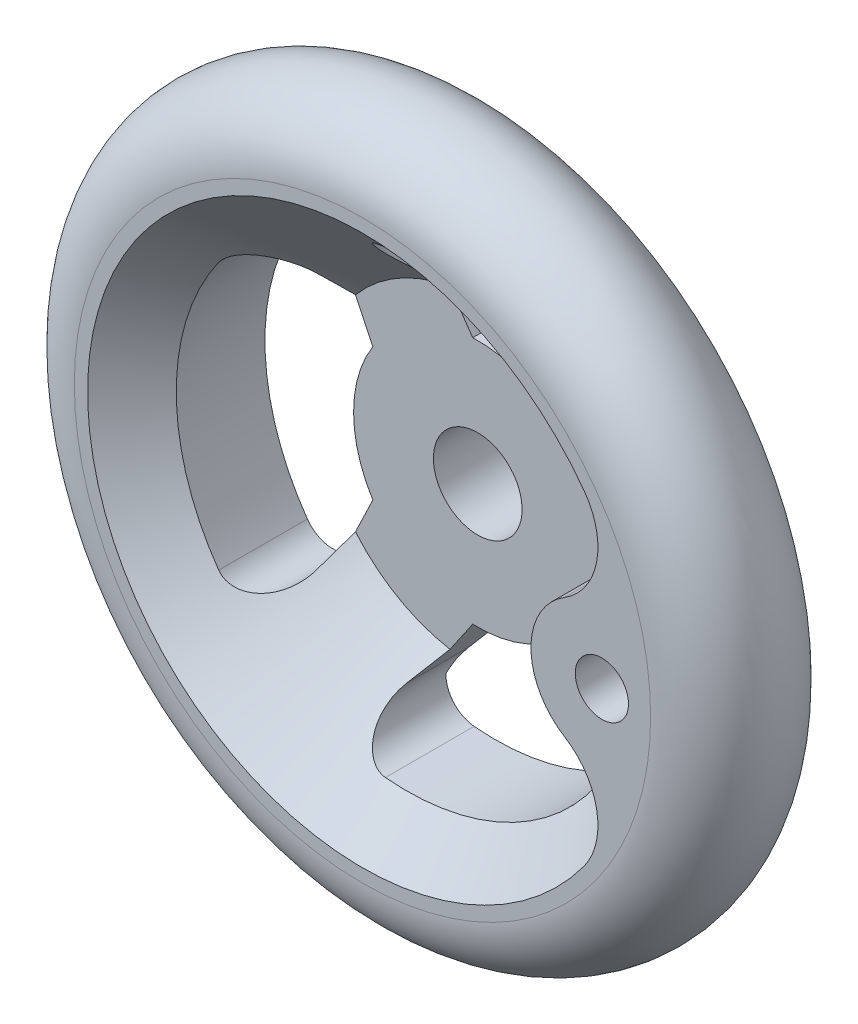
ISO-10303-21;
HEADER;
FILE_DESCRIPTION(('STEP AP214'),'2;1');
FILE_NAME('part.step','',(''),(''),'','','');
FILE_SCHEMA(('AUTOMOTIVE_DESIGN { 1 0 10303 214 1 1 1 1 }'));
ENDSEC;
DATA;
#1=APPLICATION_CONTEXT('core data for automotive mechanical design processes');
#2=APPLICATION_PROTOCOL_DEFINITION('international standard','automotive_design',2000,#1);
#3=PRODUCT_CONTEXT('',#1,'mechanical');
#4=PRODUCT('Part','Part','',(#3));
#5=PRODUCT_RELATED_PRODUCT_CATEGORY('part','',(#4));
#6=PRODUCT_DEFINITION_FORMATION('','',#4);
#7=PRODUCT_DEFINITION_CONTEXT('part definition',#1,'design');
#8=PRODUCT_DEFINITION('design','',#6,#7);
#9=PRODUCT_DEFINITION_SHAPE('','',#8);
#10=(LENGTH_UNIT() NAMED_UNIT(*) SI_UNIT(.MILLI.,.METRE.));
#11=(NAMED_UNIT(*) PLANE_ANGLE_UNIT() SI_UNIT($,.RADIAN.));
#12=(NAMED_UNIT(*) SI_UNIT($,.STERADIAN.) SOLID_ANGLE_UNIT());
#13=UNCERTAINTY_MEASURE_WITH_UNIT(LENGTH_MEASURE(1.E-05),#10,'distance_accuracy_value','');
#14=(GEOMETRIC_REPRESENTATION_CONTEXT(3) GLOBAL_UNCERTAINTY_ASSIGNED_CONTEXT((#13)) GLOBAL_UNIT_ASSIGNED_CONTEXT((#10,
#11,#12)) REPRESENTATION_CONTEXT('',''));
#15=CARTESIAN_POINT('',(0.,0.,0.));
#16=DIRECTION('',(0.,0.,1.));
#17=DIRECTION('',(1.,0.,0.));
#18=AXIS2_PLACEMENT_3D('',#15,#16,#17);
#19=CARTESIAN_POINT('',(12.292893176,1.53761816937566E-10,3.29289326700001));
#20=CARTESIAN_POINT('',(12.292893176,-24.5857863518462,3.29289326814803));
#21=CARTESIAN_POINT('',(-12.292893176,-24.5857863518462,3.29289326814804));
#22=CARTESIAN_POINT('',(-12.292893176,1.53761816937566E-10,3.29289326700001));
#23=CARTESIAN_POINT('',(12.10285038,1.44887758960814E-10,3.10285047));
#24=CARTESIAN_POINT('',(12.10285038,-24.2057007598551,3.10285047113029));
#25=CARTESIAN_POINT('',(-12.10285038,-24.2057007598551,3.10285047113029));
#26=CARTESIAN_POINT('',(-12.10285038,1.44887758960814E-10,3.10285047));
#27=CARTESIAN_POINT('',(11.99999996,1.33293243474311E-10,2.85454759));
#28=CARTESIAN_POINT('',(11.99999996,-23.9999999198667,2.85454759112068));
#29=CARTESIAN_POINT('',(-11.99999996,-23.9999999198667,2.85454759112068));
#30=CARTESIAN_POINT('',(-11.99999996,1.33293243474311E-10,2.85454759));
#31=CARTESIAN_POINT('',(11.99999996,1.20743430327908E-10,2.585786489));
#32=CARTESIAN_POINT('',(11.99999996,-23.9999999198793,2.58578649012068));
#33=CARTESIAN_POINT('',(-11.99999996,-23.9999999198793,2.58578649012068));
#34=CARTESIAN_POINT('',(-11.99999996,1.20743430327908E-10,2.585786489));
#35=(BOUNDED_SURFACE() B_SPLINE_SURFACE(3,3,((#19,#20,#21,#22),(#23,#24,#25,#26),(#27,#28,#29,
#30),(#31,#32,#33,#34)),.UNSPECIFIED.,.F.,.F.,.F.) B_SPLINE_SURFACE_WITH_KNOTS((4,4),(4,4),(0.,
1.),(0.,1.),.UNSPECIFIED.) GEOMETRIC_REPRESENTATION_ITEM() RATIONAL_B_SPLINE_SURFACE(((1.,
0.333333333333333,0.333333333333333,1.),(0.949253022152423,0.316417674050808,0.316417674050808,
0.949253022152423),(0.949253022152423,0.316417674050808,0.316417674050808,0.949253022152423),
(1.,0.333333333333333,0.333333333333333,1.))) REPRESENTATION_ITEM('') SURFACE());
#36=CARTESIAN_POINT('',(12.292893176,1.53761816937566E-10,3.29289326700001));
#37=CARTESIAN_POINT('',(12.10285038,1.44887758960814E-10,3.10285047));
#38=CARTESIAN_POINT('',(11.99999996,1.33293243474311E-10,2.85454759));
#39=CARTESIAN_POINT('',(11.99999996,1.20743430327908E-10,2.585786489));
#40=(BOUNDED_CURVE() B_SPLINE_CURVE(3,(#36,#37,#38,#39),.UNSPECIFIED.,.F.,
.F.) B_SPLINE_CURVE_WITH_KNOTS((4,4),(0.,1.),
.UNSPECIFIED.) CURVE() GEOMETRIC_REPRESENTATION_ITEM() RATIONAL_B_SPLINE_CURVE((1.,
0.949253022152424,0.949253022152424,1.)) REPRESENTATION_ITEM(''));
#41=CARTESIAN_POINT('',(11.99999996,-2.34049770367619E-09,2.585786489));
#42=VERTEX_POINT('',#41);
#43=CARTESIAN_POINT('',(12.292893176,1.53761816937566E-10,3.292893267));
#44=VERTEX_POINT('',#43);
#45=EDGE_CURVE('E500',#42,#44,#40,.F.);
#46=CARTESIAN_POINT('',(0.,1.53761816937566E-10,3.292893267));
#47=DIRECTION('',(0.,4.6695050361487E-11,1.));
#48=DIRECTION('',(1.,0.,0.));
#49=AXIS2_PLACEMENT_3D('',#46,#47,#48);
#50=CIRCLE('',#49,12.292893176);
#51=CARTESIAN_POINT('',(-12.292893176,-3.6282099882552E-09,3.292893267));
#52=VERTEX_POINT('',#51);
#53=EDGE_CURVE('E242',#52,#44,#50,.T.);
#54=CARTESIAN_POINT('',(-12.292893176,1.53761816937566E-10,3.29289326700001));
#55=CARTESIAN_POINT('',(-12.10285038,1.44887758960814E-10,3.10285047));
#56=CARTESIAN_POINT('',(-11.99999996,1.33293243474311E-10,2.85454759));
#57=CARTESIAN_POINT('',(-11.99999996,1.20743430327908E-10,2.585786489));
#58=(BOUNDED_CURVE() B_SPLINE_CURVE(3,(#54,#55,#56,#57),.UNSPECIFIED.,.F.,
.F.) B_SPLINE_CURVE_WITH_KNOTS((4,4),(0.,1.),
.UNSPECIFIED.) CURVE() GEOMETRIC_REPRESENTATION_ITEM() RATIONAL_B_SPLINE_CURVE((1.,
0.949253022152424,0.949253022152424,1.)) REPRESENTATION_ITEM(''));
#59=CARTESIAN_POINT('',(-11.99999996,-4.18018338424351E-10,2.585786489));
#60=VERTEX_POINT('',#59);
#61=EDGE_CURVE('E493',#52,#60,#58,.T.);
#62=CARTESIAN_POINT('',(0.,1.20743430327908E-10,2.585786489));
#63=DIRECTION('',(0.,-4.6695050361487E-11,-1.));
#64=DIRECTION('',(-1.,0.,0.));
#65=AXIS2_PLACEMENT_3D('',#62,#63,#64);
#66=CIRCLE('',#65,11.99999996);
#67=EDGE_CURVE('E490',#42,#60,#66,.T.);
#68=ORIENTED_EDGE('',*,*,#45,.T.);
#69=ORIENTED_EDGE('',*,*,#53,.F.);
#70=ORIENTED_EDGE('',*,*,#61,.T.);
#71=ORIENTED_EDGE('',*,*,#67,.F.);
#72=EDGE_LOOP('',(#68,#69,#70,#71));
#73=FACE_BOUND('',#72,.T.);
#74=ADVANCED_FACE('F15',(#73),#35,.F.);
#75=CARTESIAN_POINT('',(0.,1.20743430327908E-10,2.585786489));
#76=DIRECTION('',(0.,-4.6695050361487E-11,-1.));
#77=DIRECTION('',(0.,1.,-4.6695050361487E-11));
#78=AXIS2_PLACEMENT_3D('',#75,#76,#77);
#79=CYLINDRICAL_SURFACE('',#78,11.99999996);
#80=CARTESIAN_POINT('',(0.,0.,0.));
#81=DIRECTION('',(0.,-4.6695050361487E-11,-1.));
#82=DIRECTION('',(0.,1.,-4.6695050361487E-11));
#83=AXIS2_PLACEMENT_3D('',#80,#81,#82);
#84=CIRCLE('',#83,11.99999996);
#85=CARTESIAN_POINT('',(0.,11.99999996,-5.60340602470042E-10));
#86=VERTEX_POINT('',#85);
#87=EDGE_CURVE('E529',#86,#86,#84,.F.);
#88=ORIENTED_EDGE('',*,*,#87,.T.);
#89=EDGE_LOOP('',(#88));
#90=FACE_BOUND('',#89,.T.);
#91=CARTESIAN_POINT('',(0.,1.20743430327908E-10,2.585786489));
#92=DIRECTION('',(0.,-4.6695050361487E-11,-1.));
#93=DIRECTION('',(0.,1.,-4.6695050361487E-11));
#94=AXIS2_PLACEMENT_3D('',#91,#92,#93);
#95=CIRCLE('',#94,11.99999996);
#96=EDGE_CURVE('E496',#60,#42,#95,.T.);
#97=ORIENTED_EDGE('',*,*,#96,.T.);
#98=ORIENTED_EDGE('',*,*,#67,.T.);
#99=EDGE_LOOP('',(#97,#98));
#100=FACE_BOUND('',#99,.T.);
#101=ADVANCED_FACE('F937',(#90,#100),#79,.T.);
#102=CARTESIAN_POINT('',(-12.292893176,1.53761816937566E-10,3.29289326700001));
#103=CARTESIAN_POINT('',(-12.292893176,24.5857863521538,3.29289326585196));
#104=CARTESIAN_POINT('',(12.292893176,24.5857863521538,3.29289326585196));
#105=CARTESIAN_POINT('',(12.292893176,1.53761816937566E-10,3.29289326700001));
#106=CARTESIAN_POINT('',(-12.10285038,1.44887758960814E-10,3.10285047));
#107=CARTESIAN_POINT('',(-12.10285038,24.2057007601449,3.10285046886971));
#108=CARTESIAN_POINT('',(12.10285038,24.2057007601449,3.10285046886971));
#109=CARTESIAN_POINT('',(12.10285038,1.44887758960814E-10,3.10285047));
#110=CARTESIAN_POINT('',(-11.99999996,1.33293243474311E-10,2.85454759));
#111=CARTESIAN_POINT('',(-11.99999996,23.9999999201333,2.85454758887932));
#112=CARTESIAN_POINT('',(11.99999996,23.9999999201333,2.85454758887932));
#113=CARTESIAN_POINT('',(11.99999996,1.33293243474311E-10,2.85454759));
#114=CARTESIAN_POINT('',(-11.99999996,1.20743430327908E-10,2.585786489));
#115=CARTESIAN_POINT('',(-11.99999996,23.9999999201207,2.58578648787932));
#116=CARTESIAN_POINT('',(11.99999996,23.9999999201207,2.58578648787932));
#117=CARTESIAN_POINT('',(11.99999996,1.20743430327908E-10,2.585786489));
#118=(BOUNDED_SURFACE() B_SPLINE_SURFACE(3,3,((#102,#103,#104,#105),(#106,#107,#108,#109),(#110,
#111,#112,#113),(#114,#115,#116,#117)),.UNSPECIFIED.,.F.,.F.,
.F.) B_SPLINE_SURFACE_WITH_KNOTS((4,4),(4,4),(0.,1.),(0.,1.),
.UNSPECIFIED.) GEOMETRIC_REPRESENTATION_ITEM() RATIONAL_B_SPLINE_SURFACE(((1.,0.333333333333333,
0.333333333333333,1.),(0.949253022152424,0.316417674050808,0.316417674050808,0.949253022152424),
(0.949253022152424,0.316417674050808,0.316417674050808,0.949253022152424),(1.,0.333333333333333,
0.333333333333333,1.))) REPRESENTATION_ITEM('') SURFACE());
#119=CARTESIAN_POINT('',(0.,1.53761816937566E-10,3.292893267));
#120=DIRECTION('',(0.,4.6695050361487E-11,1.));
#121=DIRECTION('',(1.,0.,0.));
#122=AXIS2_PLACEMENT_3D('',#119,#120,#121);
#123=CIRCLE('',#122,12.292893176);
#124=EDGE_CURVE('E524',#44,#52,#123,.T.);
#125=ORIENTED_EDGE('',*,*,#96,.F.);
#126=ORIENTED_EDGE('',*,*,#61,.F.);
#127=ORIENTED_EDGE('',*,*,#124,.F.);
#128=ORIENTED_EDGE('',*,*,#45,.F.);
#129=EDGE_LOOP('',(#125,#126,#127,#128));
#130=FACE_BOUND('',#129,.T.);
#131=ADVANCED_FACE('F958',(#130),#118,.F.);
#132=CARTESIAN_POINT('',(0.,1.00394338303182E-09,21.500000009));
#133=DIRECTION('',(0.,-4.66950236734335E-11,-1.));
#134=DIRECTION('',(0.,1.,-4.66950236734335E-11));
#135=AXIS2_PLACEMENT_3D('',#132,#133,#134);
#136=TOROIDAL_SURFACE('',#135,32.5,7.5);
#137=CARTESIAN_POINT('',(0.,6.53730705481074E-10,14.000000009));
#138=DIRECTION('',(0.,-4.66950236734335E-11,-1.));
#139=DIRECTION('',(0.,1.,-4.66950236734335E-11));
#140=AXIS2_PLACEMENT_3D('',#137,#138,#139);
#141=CIRCLE('',#140,32.49999998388);
#142=CARTESIAN_POINT('',(0.,32.4999999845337,14.0000000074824));
#143=VERTEX_POINT('',#142);
#144=EDGE_CURVE('E567',#143,#143,#141,.F.);
#145=ORIENTED_EDGE('',*,*,#144,.T.);
#146=EDGE_LOOP('',(#145));
#147=FACE_BOUND('',#146,.T.);
#148=CARTESIAN_POINT('',(0.,1.35415606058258E-09,29.000000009));
#149=DIRECTION('',(0.,-4.66950236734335E-11,-1.));
#150=DIRECTION('',(0.,1.,-4.66950236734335E-11));
#151=AXIS2_PLACEMENT_3D('',#148,#149,#150);
#152=CIRCLE('',#151,32.49999998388);
#153=CARTESIAN_POINT('',(0.,32.4999999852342,29.0000000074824));
#154=VERTEX_POINT('',#153);
#155=EDGE_CURVE('E561',#154,#154,#152,.T.);
#156=ORIENTED_EDGE('',*,*,#155,.T.);
#157=EDGE_LOOP('',(#156));
#158=FACE_BOUND('',#157,.T.);
#159=ADVANCED_FACE('F468',(#147,#158),#136,.T.);
#160=CARTESIAN_POINT('',(27.,6.53730705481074E-10,14.000000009));
#161=DIRECTION('',(0.,4.6695050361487E-11,1.));
#162=DIRECTION('',(0.,-1.,4.6695050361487E-11));
#163=AXIS2_PLACEMENT_3D('',#160,#161,#162);
#164=CYLINDRICAL_SURFACE('',#163,3.);
#165=CARTESIAN_POINT('',(27.,6.53730705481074E-10,14.000000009));
#166=DIRECTION('',(0.,4.6695050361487E-11,1.));
#167=DIRECTION('',(0.,-1.,4.6695050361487E-11));
#168=AXIS2_PLACEMENT_3D('',#165,#166,#167);
#169=CIRCLE('',#168,3.);
#170=CARTESIAN_POINT('',(27.,-2.99999999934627,14.0000000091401));
#171=VERTEX_POINT('',#170);
#172=EDGE_CURVE('E869',#171,#171,#169,.F.);
#173=ORIENTED_EDGE('',*,*,#172,.T.);
#174=EDGE_LOOP('',(#173));
#175=FACE_BOUND('',#174,.T.);
#176=CARTESIAN_POINT('',(27.,1.35415646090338E-09,29.000000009));
#177=DIRECTION('',(0.,4.6695050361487E-11,1.));
#178=DIRECTION('',(0.,-1.,4.6695050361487E-11));
#179=AXIS2_PLACEMENT_3D('',#176,#177,#178);
#180=CIRCLE('',#179,3.);
#181=CARTESIAN_POINT('',(27.,-2.99999999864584,29.0000000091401));
#182=VERTEX_POINT('',#181);
#183=EDGE_CURVE('E883',#182,#182,#180,.T.);
#184=ORIENTED_EDGE('',*,*,#183,.T.);
#185=EDGE_LOOP('',(#184));
#186=FACE_BOUND('',#185,.T.);
#187=ADVANCED_FACE('F957',(#175,#186),#164,.F.);
#188=CARTESIAN_POINT('',(0.,6.53730705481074E-10,14.000000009));
#189=DIRECTION('',(0.,4.6695050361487E-11,1.));
#190=DIRECTION('',(0.,-1.,4.6695050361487E-11));
#191=AXIS2_PLACEMENT_3D('',#188,#189,#190);
#192=CYLINDRICAL_SURFACE('',#191,26.);
#193=CARTESIAN_POINT('',(0.,1.1206812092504E-09,24.0000000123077));
#194=DIRECTION('',(0.,4.6695050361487E-11,1.));
#195=DIRECTION('',(1.,0.,0.));
#196=AXIS2_PLACEMENT_3D('',#193,#194,#195);
#197=CIRCLE('',#196,26.0000000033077);
#198=CARTESIAN_POINT('',(23.6265645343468,10.8529004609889,24.0000000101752));
#199=VERTEX_POINT('',#198);
#200=CARTESIAN_POINT('',(-2.41439476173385,25.8876553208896,24.0000000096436));
#201=VERTEX_POINT('',#200);
#202=EDGE_CURVE('E569',#199,#201,#197,.T.);
#203=ORIENTED_EDGE('',*,*,#202,.T.);
#204=DIRECTION('',(0.,-4.6695050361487E-11,-1.));
#205=VECTOR('',#204,1.);
#206=CARTESIAN_POINT('',(-2.41439476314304,25.8876553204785,18.0116940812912));
#207=LINE('',#206,#205);
#208=CARTESIAN_POINT('',(-2.41439476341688,25.8876553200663,14.000000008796));
#209=VERTEX_POINT('',#208);
#210=EDGE_CURVE('E521',#201,#209,#207,.T.);
#211=ORIENTED_EDGE('',*,*,#210,.T.);
#212=CARTESIAN_POINT('',(0.,6.53730705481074E-10,14.000000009));
#213=DIRECTION('',(0.,4.6695050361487E-11,1.));
#214=DIRECTION('',(0.,-1.,4.6695050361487E-11));
#215=AXIS2_PLACEMENT_3D('',#212,#213,#214);
#216=CIRCLE('',#215,26.);
#217=CARTESIAN_POINT('',(23.6265645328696,10.8529004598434,14.0000000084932));
#218=VERTEX_POINT('',#217);
#219=EDGE_CURVE('E816',#209,#218,#216,.F.);
#220=ORIENTED_EDGE('',*,*,#219,.T.);
#221=DIRECTION('',(0.,4.6695050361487E-11,1.));
#222=VECTOR('',#221,1.);
#223=CARTESIAN_POINT('',(23.6265645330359,10.8529004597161,19.0300000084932));
#224=LINE('',#223,#222);
#225=EDGE_CURVE('E547',#218,#199,#224,.T.);
#226=ORIENTED_EDGE('',*,*,#225,.T.);
#227=EDGE_LOOP('',(#203,#211,#220,#226));
#228=FACE_BOUND('',#227,.T.);
#229=ADVANCED_FACE('F811',(#228),#192,.F.);
#230=CARTESIAN_POINT('',(-2.089380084,22.4027786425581,11.9515284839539));
#231=DIRECTION('',(0.,4.66952981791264E-11,1.));
#232=DIRECTION('',(0.,-1.,4.66952981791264E-11));
#233=AXIS2_PLACEMENT_3D('',#230,#231,#232);
#234=CYLINDRICAL_SURFACE('',#233,3.5);
#235=CARTESIAN_POINT('',(-2.41439476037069,25.8876553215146,24.0000000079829));
#236=CARTESIAN_POINT('',(-2.49531943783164,25.8801261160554,24.0000142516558));
#237=CARTESIAN_POINT('',(-2.5759659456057,25.8697438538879,23.9975506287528));
#238=CARTESIAN_POINT('',(-2.73601371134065,25.8434768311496,23.9877773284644));
#239=CARTESIAN_POINT('',(-2.81541566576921,25.8275952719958,23.9804704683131));
#240=CARTESIAN_POINT('',(-2.97183811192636,25.7906522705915,23.9611870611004));
#241=CARTESIAN_POINT('',(-3.04887127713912,25.7696274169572,23.9492431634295));
#242=CARTESIAN_POINT('',(-3.20056206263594,25.7226564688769,23.9208900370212));
#243=CARTESIAN_POINT('',(-3.27521944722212,25.6967098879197,23.9044803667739));
#244=CARTESIAN_POINT('',(-3.49458678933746,25.6121166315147,23.8489762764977));
#245=CARTESIAN_POINT('',(-3.63515165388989,25.5466053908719,23.8035482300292));
#246=CARTESIAN_POINT('',(-3.90235624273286,25.4005163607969,23.6981336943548));
#247=CARTESIAN_POINT('',(-4.02897048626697,25.3199117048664,23.6381211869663));
#248=CARTESIAN_POINT('',(-4.30617778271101,25.1182978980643,23.4841421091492));
#249=CARTESIAN_POINT('',(-4.45087813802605,24.9927368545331,23.3855077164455));
#250=CARTESIAN_POINT('',(-4.71252626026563,24.7274233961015,23.1720072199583));
#251=CARTESIAN_POINT('',(-4.82943128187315,24.5876495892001,23.0571165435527));
#252=CARTESIAN_POINT('',(-5.07013944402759,24.2522170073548,22.7759270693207));
#253=CARTESIAN_POINT('',(-5.18383377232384,24.05316054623,22.6050568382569));
#254=CARTESIAN_POINT('',(-5.36801006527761,23.6478768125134,22.2491177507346));
#255=CARTESIAN_POINT('',(-5.43842610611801,23.4416391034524,22.0640277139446));
#256=CARTESIAN_POINT('',(-5.52151636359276,23.1021340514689,21.752725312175));
#257=CARTESIAN_POINT('',(-5.54583505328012,22.9691522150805,21.6291335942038));
#258=CARTESIAN_POINT('',(-5.57897139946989,22.7038386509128,21.379199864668));
#259=CARTESIAN_POINT('',(-5.58778470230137,22.5715071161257,21.2528570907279));
#260=CARTESIAN_POINT('',(-5.59197856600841,22.1768454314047,20.8708969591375));
#261=CARTESIAN_POINT('',(-5.56513277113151,21.9167628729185,20.6122695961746));
#262=CARTESIAN_POINT('',(-5.48674655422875,21.5539622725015,20.2413538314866));
#263=CARTESIAN_POINT('',(-5.45781915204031,21.4455836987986,20.1291852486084));
#264=CARTESIAN_POINT('',(-5.38958230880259,21.2317763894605,19.9051557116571));
#265=CARTESIAN_POINT('',(-5.35027472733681,21.1263471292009,19.7932947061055));
#266=CARTESIAN_POINT('',(-5.26145219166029,20.9193299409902,19.5708345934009));
#267=CARTESIAN_POINT('',(-5.2119718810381,20.8177303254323,19.4602325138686));
#268=CARTESIAN_POINT('',(-5.10257609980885,20.6185380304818,19.2405196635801));
#269=CARTESIAN_POINT('',(-5.04265702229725,20.5209467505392,19.1314094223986));
#270=CARTESIAN_POINT('',(-4.97746161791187,20.4256633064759,19.0233880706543));
#271=B_SPLINE_CURVE_WITH_KNOTS('',3,(#235,#236,#237,#238,#239,#240,#241,#242,#243,#244,#245,
#246,#247,#248,#249,#250,#251,#252,#253,#254,#255,#256,#257,#258,#259,#260,#261,#262,#263,#264,
#265,#266,#267,#268,#269,#270),.UNSPECIFIED.,.F.,.F.,(4,2,2,2,2,2,2,2,2,2,2,2,2,2,2,2,2,4),(0.,
0.243715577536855,0.487289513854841,0.729178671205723,0.971091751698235,1.4535070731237,
1.93678940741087,2.57969605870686,3.22358510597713,4.07676239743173,4.93123609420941,
5.48007557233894,6.02906913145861,7.12670817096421,7.60237336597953,8.07795340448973,
8.55193989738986,9.02609049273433),.UNSPECIFIED.);
#272=CARTESIAN_POINT('',(-4.97746161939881,20.4256633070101,19.0233880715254));
#273=VERTEX_POINT('',#272);
#274=EDGE_CURVE('E271',#201,#273,#271,.T.);
#275=ORIENTED_EDGE('',*,*,#274,.T.);
#276=DIRECTION('',(0.,-4.6695050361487E-11,-1.));
#277=VECTOR('',#276,1.);
#278=CARTESIAN_POINT('',(-4.97746162,20.4256633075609,12.0116940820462));
#279=LINE('',#278,#277);
#280=CARTESIAN_POINT('',(-4.97746162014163,20.4256633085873,12.0233881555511));
#281=VERTEX_POINT('',#280);
#282=EDGE_CURVE('E608',#273,#281,#279,.T.);
#283=ORIENTED_EDGE('',*,*,#282,.T.);
#284=CARTESIAN_POINT('',(-5.58817161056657,22.310812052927,14.0000000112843));
#285=CARTESIAN_POINT('',(-5.58443372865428,22.1701425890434,13.8626564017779));
#286=CARTESIAN_POINT('',(-5.5723168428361,22.0306100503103,13.7244038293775));
#287=CARTESIAN_POINT('',(-5.53168914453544,21.7546676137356,13.4469311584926));
#288=CARTESIAN_POINT('',(-5.5031631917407,21.6182607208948,13.3077102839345));
#289=CARTESIAN_POINT('',(-5.4307260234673,21.352020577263,13.0318321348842));
#290=CARTESIAN_POINT('',(-5.38709138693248,21.2221142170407,12.8951724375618));
#291=CARTESIAN_POINT('',(-5.28445226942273,20.9673844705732,12.6230497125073));
#292=CARTESIAN_POINT('',(-5.2254603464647,20.8425570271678,12.4875858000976));
#293=CARTESIAN_POINT('',(-5.1312235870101,20.6705951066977,12.2979520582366));
#294=CARTESIAN_POINT('',(-5.10241065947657,20.6209341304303,12.2428155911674));
#295=CARTESIAN_POINT('',(-5.04201167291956,20.5225370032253,12.1328205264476));
#296=CARTESIAN_POINT('',(-5.01041594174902,20.4738048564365,12.0779636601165));
#297=CARTESIAN_POINT('',(-4.97746161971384,20.4256633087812,12.0233881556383));
#298=B_SPLINE_CURVE_WITH_KNOTS('',3,(#284,#285,#286,#287,#288,#289,#290,#291,#292,#293,#294,
#295,#296,#297),.UNSPECIFIED.,.F.,.F.,(4,2,2,2,2,2,4),(0.,0.589696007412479,1.17993699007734,
1.75989917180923,2.33938858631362,2.57814975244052,2.81777625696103),.UNSPECIFIED.);
#299=CARTESIAN_POINT('',(-5.5881716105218,22.3108120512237,14.0000000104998));
#300=VERTEX_POINT('',#299);
#301=EDGE_CURVE('E562',#300,#281,#298,.T.);
#302=ORIENTED_EDGE('',*,*,#301,.F.);
#303=CARTESIAN_POINT('',(-2.089380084,22.4027786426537,14.000000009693));
#304=DIRECTION('',(0.,4.66952981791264E-11,1.));
#305=DIRECTION('',(0.,-1.,4.66952981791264E-11));
#306=AXIS2_PLACEMENT_3D('',#303,#304,#305);
#307=CIRCLE('',#306,3.5);
#308=EDGE_CURVE('E1235',#300,#209,#307,.F.);
#309=ORIENTED_EDGE('',*,*,#308,.T.);
#310=ORIENTED_EDGE('',*,*,#210,.F.);
#311=EDGE_LOOP('',(#275,#283,#302,#309,#310));
#312=FACE_BOUND('',#311,.T.);
#313=ADVANCED_FACE('F808',(#312),#234,.F.);
#314=CARTESIAN_POINT('',(-18.356685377,13.0108455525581,11.9515284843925));
#315=DIRECTION('',(0.,4.66952981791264E-11,1.));
#316=DIRECTION('',(0.,-1.,4.66952981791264E-11));
#317=AXIS2_PLACEMENT_3D('',#314,#315,#316);
#318=CYLINDRICAL_SURFACE('',#317,3.5);
#319=DIRECTION('',(0.,4.6695050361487E-11,1.));
#320=VECTOR('',#319,1.);
#321=CARTESIAN_POINT('',(-15.200412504,14.5234398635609,12.0116940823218));
#322=LINE('',#321,#320);
#323=CARTESIAN_POINT('',(-15.2004125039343,14.5234398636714,12.0233881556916));
#324=VERTEX_POINT('',#323);
#325=CARTESIAN_POINT('',(-15.2004125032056,14.5234398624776,19.0233880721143));
#326=VERTEX_POINT('',#325);
#327=EDGE_CURVE('E414',#324,#326,#322,.T.);
#328=ORIENTED_EDGE('',*,*,#327,.T.);
#329=CARTESIAN_POINT('',(-15.2004125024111,14.5234398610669,19.0233880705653));
#330=CARTESIAN_POINT('',(-15.230400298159,14.5860056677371,19.0882931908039));
#331=CARTESIAN_POINT('',(-15.2620713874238,14.6473280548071,19.1535965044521));
#332=CARTESIAN_POINT('',(-15.3286447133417,14.7674589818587,19.2848484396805));
#333=CARTESIAN_POINT('',(-15.3635465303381,14.8262678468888,19.3507969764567));
#334=CARTESIAN_POINT('',(-15.4728755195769,14.998857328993,19.5493515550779));
#335=CARTESIAN_POINT('',(-15.5519526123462,15.1088554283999,19.6827234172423));
#336=CARTESIAN_POINT('',(-15.7221486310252,15.3190072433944,19.9512568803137));
#337=CARTESIAN_POINT('',(-15.8133417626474,15.4190930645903,20.0864244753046));
#338=CARTESIAN_POINT('',(-16.0066206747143,15.6080505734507,20.3567263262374));
#339=CARTESIAN_POINT('',(-16.1087074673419,15.6969212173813,20.4918605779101));
#340=CARTESIAN_POINT('',(-16.431819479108,15.9467054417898,20.8976126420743));
#341=CARTESIAN_POINT('',(-16.6688288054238,16.0897193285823,21.167210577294));
#342=CARTESIAN_POINT('',(-17.0515972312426,16.2614220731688,21.5624459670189));
#343=CARTESIAN_POINT('',(-17.1836256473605,16.3114995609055,21.692574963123));
#344=CARTESIAN_POINT('',(-17.4562541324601,16.3960449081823,21.94884333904));
#345=CARTESIAN_POINT('',(-17.5968500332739,16.4305202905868,22.0749846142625));
#346=CARTESIAN_POINT('',(-17.9342896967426,16.4907914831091,22.3633671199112));
#347=CARTESIAN_POINT('',(-18.134193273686,16.5098065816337,22.5235394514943));
#348=CARTESIAN_POINT('',(-18.5446222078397,16.5117992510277,22.8298997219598));
#349=CARTESIAN_POINT('',(-18.7551323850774,16.4948269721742,22.9761068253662));
#350=CARTESIAN_POINT('',(-19.1348181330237,16.4274373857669,23.2187380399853));
#351=CARTESIAN_POINT('',(-19.3029361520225,16.3851694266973,23.3190485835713));
#352=CARTESIAN_POINT('',(-19.638571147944,16.2724396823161,23.503785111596));
#353=CARTESIAN_POINT('',(-19.8060885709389,16.2020075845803,23.5882276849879));
#354=CARTESIAN_POINT('',(-20.1060917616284,16.0461316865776,23.7237957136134));
#355=CARTESIAN_POINT('',(-20.2395834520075,15.9654624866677,23.7781647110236));
#356=CARTESIAN_POINT('',(-20.4980560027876,15.7838163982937,23.8703781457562));
#357=CARTESIAN_POINT('',(-20.6230519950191,15.6828769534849,23.9082526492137));
#358=CARTESIAN_POINT('',(-20.8279089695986,15.4921766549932,23.9575770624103));
#359=CARTESIAN_POINT('',(-20.9108202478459,15.4068023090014,23.9734068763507));
#360=CARTESIAN_POINT('',(-21.0288175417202,15.2721044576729,23.9893206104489));
#361=CARTESIAN_POINT('',(-21.0671393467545,15.2260273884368,23.9933201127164));
#362=CARTESIAN_POINT('',(-21.141450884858,15.1318559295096,23.9986616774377));
#363=CARTESIAN_POINT('',(-21.1774397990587,15.0837608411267,24.0000028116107));
#364=CARTESIAN_POINT('',(-21.2121697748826,15.0347548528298,24.0000000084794));
#365=B_SPLINE_CURVE_WITH_KNOTS('',3,(#329,#330,#331,#332,#333,#334,#335,#336,#337,#338,#339,
#340,#341,#342,#343,#344,#345,#346,#347,#348,#349,#350,#351,#352,#353,#354,#355,#356,#357,#358,
#359,#360,#361,#362,#363,#364),.UNSPECIFIED.,.F.,.F.,(4,2,2,2,2,2,2,2,2,2,2,2,2,2,2,2,2,4),(0.,
0.284970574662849,0.569904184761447,1.13952288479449,1.71280661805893,2.28614366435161,
3.43858375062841,4.01398669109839,4.58911189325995,5.3569774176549,6.1237735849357,
6.72243733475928,7.3204716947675,7.81399229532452,8.30660950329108,8.66569562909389,
8.84576222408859,9.02589168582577),.UNSPECIFIED.);
#366=CARTESIAN_POINT('',(-21.2121697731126,15.0347548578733,24.0000000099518));
#367=VERTEX_POINT('',#366);
#368=EDGE_CURVE('E380',#326,#367,#365,.T.);
#369=ORIENTED_EDGE('',*,*,#368,.T.);
#370=DIRECTION('',(0.,-4.6695050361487E-11,-1.));
#371=VECTOR('',#370,1.);
#372=CARTESIAN_POINT('',(-21.21216977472,15.034754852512,19.0000000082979));
#373=LINE('',#372,#371);
#374=CARTESIAN_POINT('',(-21.2121697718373,15.0347548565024,14.0000000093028));
#375=VERTEX_POINT('',#374);
#376=EDGE_CURVE('E537',#367,#375,#373,.T.);
#377=ORIENTED_EDGE('',*,*,#376,.T.);
#378=CARTESIAN_POINT('',(-18.356685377,13.0108455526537,14.0000000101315));
#379=DIRECTION('',(0.,4.66952981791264E-11,1.));
#380=DIRECTION('',(0.,-1.,4.66952981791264E-11));
#381=AXIS2_PLACEMENT_3D('',#378,#379,#380);
#382=CIRCLE('',#381,3.5);
#383=CARTESIAN_POINT('',(-16.5276442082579,15.9949046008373,14.0000000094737));
#384=VERTEX_POINT('',#383);
#385=EDGE_CURVE('E1227',#375,#384,#382,.F.);
#386=ORIENTED_EDGE('',*,*,#385,.T.);
#387=CARTESIAN_POINT('',(-15.2004125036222,14.5234398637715,12.0233881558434));
#388=CARTESIAN_POINT('',(-15.2307387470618,14.5867108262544,12.0890251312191));
#389=CARTESIAN_POINT('',(-15.2627853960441,14.648709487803,12.1550680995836));
#390=CARTESIAN_POINT('',(-15.3301827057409,14.7701379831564,12.2878146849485));
#391=CARTESIAN_POINT('',(-15.3655330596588,14.8295680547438,12.3545182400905));
#392=CARTESIAN_POINT('',(-15.4763542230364,15.0040032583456,12.5554307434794));
#393=CARTESIAN_POINT('',(-15.5565862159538,15.1151349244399,12.6904223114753));
#394=CARTESIAN_POINT('',(-15.7273621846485,15.324856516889,12.9590739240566));
#395=CARTESIAN_POINT('',(-15.8177141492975,15.4236231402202,13.0927191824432));
#396=CARTESIAN_POINT('',(-16.0090595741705,15.6101702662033,13.3599508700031));
#397=CARTESIAN_POINT('',(-16.1100468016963,15.6979571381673,13.4935372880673));
#398=CARTESIAN_POINT('',(-16.2657053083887,15.8182893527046,13.6890151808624));
#399=CARTESIAN_POINT('',(-16.3164598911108,15.8553930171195,13.7512690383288));
#400=CARTESIAN_POINT('',(-16.4203303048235,15.9270972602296,13.8757420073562));
#401=CARTESIAN_POINT('',(-16.4734546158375,15.9616874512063,13.9379600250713));
#402=CARTESIAN_POINT('',(-16.5276442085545,15.9949046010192,14.0000000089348));
#403=B_SPLINE_CURVE_WITH_KNOTS('',3,(#387,#388,#389,#390,#391,#392,#393,#394,#395,#396,#397,
#398,#399,#400,#401,#402),.UNSPECIFIED.,.F.,.F.,(4,2,2,2,2,2,2,4),(0.,0.288179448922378,
0.576332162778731,1.15272159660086,1.71959970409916,2.28614742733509,2.55152386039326,
2.81794108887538),.UNSPECIFIED.);
#404=EDGE_CURVE('E528',#324,#384,#403,.T.);
#405=ORIENTED_EDGE('',*,*,#404,.F.);
#406=EDGE_LOOP('',(#328,#369,#377,#386,#405));
#407=FACE_BOUND('',#406,.T.);
#408=ADVANCED_FACE('F904',(#407),#318,.F.);
#409=CARTESIAN_POINT('',(0.,6.53730705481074E-10,14.000000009));
#410=DIRECTION('',(0.,4.6695050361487E-11,1.));
#411=DIRECTION('',(0.,-1.,4.6695050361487E-11));
#412=AXIS2_PLACEMENT_3D('',#409,#410,#411);
#413=CYLINDRICAL_SURFACE('',#412,26.);
#414=CARTESIAN_POINT('',(0.,1.1206812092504E-09,24.0000000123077));
#415=DIRECTION('',(0.,4.6695050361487E-11,1.));
#416=DIRECTION('',(1.,0.,0.));
#417=AXIS2_PLACEMENT_3D('',#414,#415,#416);
#418=CIRCLE('',#417,26.0000000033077);
#419=CARTESIAN_POINT('',(-21.2121697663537,-15.0347548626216,24.0000000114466));
#420=VERTEX_POINT('',#419);
#421=EDGE_CURVE('E541',#367,#420,#418,.T.);
#422=ORIENTED_EDGE('',*,*,#421,.T.);
#423=DIRECTION('',(0.,-4.6695050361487E-11,-1.));
#424=VECTOR('',#423,1.);
#425=CARTESIAN_POINT('',(-21.2121697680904,-15.0347548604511,18.0116940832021));
#426=LINE('',#425,#424);
#427=CARTESIAN_POINT('',(-21.2121697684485,-15.0347548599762,14.0000000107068));
#428=VERTEX_POINT('',#427);
#429=EDGE_CURVE('E533',#420,#428,#426,.T.);
#430=ORIENTED_EDGE('',*,*,#429,.T.);
#431=CARTESIAN_POINT('',(0.,6.53730705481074E-10,14.000000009));
#432=DIRECTION('',(0.,4.6695050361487E-11,1.));
#433=DIRECTION('',(0.,-1.,4.6695050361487E-11));
#434=AXIS2_PLACEMENT_3D('',#431,#432,#433);
#435=CIRCLE('',#434,26.);
#436=EDGE_CURVE('E1224',#428,#375,#435,.F.);
#437=ORIENTED_EDGE('',*,*,#436,.T.);
#438=ORIENTED_EDGE('',*,*,#376,.F.);
#439=EDGE_LOOP('',(#422,#430,#437,#438));
#440=FACE_BOUND('',#439,.T.);
#441=ADVANCED_FACE('F910',(#440),#413,.F.);
#442=CARTESIAN_POINT('',(-2.089380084,-22.4027786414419,11.9515284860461));
#443=DIRECTION('',(0.,4.66952981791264E-11,1.));
#444=DIRECTION('',(0.,-1.,4.66952981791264E-11));
#445=AXIS2_PLACEMENT_3D('',#442,#443,#444);
#446=CYLINDRICAL_SURFACE('',#445,3.5);
#447=DIRECTION('',(0.,4.6695050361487E-11,1.));
#448=VECTOR('',#447,1.);
#449=CARTESIAN_POINT('',(-4.97746162,-20.4256633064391,12.0116940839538));
#450=LINE('',#449,#448);
#451=CARTESIAN_POINT('',(-4.97746161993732,-20.4256633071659,12.0233881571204));
#452=VERTEX_POINT('',#451);
#453=CARTESIAN_POINT('',(-4.97746161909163,-20.4256633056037,19.0233880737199));
#454=VERTEX_POINT('',#453);
#455=EDGE_CURVE('E232',#452,#454,#450,.T.);
#456=ORIENTED_EDGE('',*,*,#455,.T.);
#457=CARTESIAN_POINT('',(-4.97746161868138,-20.4256633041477,19.0233880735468));
#458=CARTESIAN_POINT('',(-5.01665129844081,-20.4829164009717,19.0882931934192));
#459=CARTESIAN_POINT('',(-5.05392249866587,-20.5410055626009,19.1535965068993));
#460=CARTESIAN_POINT('',(-5.12467227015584,-20.6587252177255,19.2848484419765));
#461=CARTESIAN_POINT('',(-5.15815133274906,-20.7183555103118,19.3507969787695));
#462=CARTESIAN_POINT('',(-5.25295371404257,-20.8993319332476,19.5493515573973));
#463=CARTESIAN_POINT('',(-5.30867631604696,-21.0228137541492,19.6827234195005));
#464=CARTESIAN_POINT('',(-5.40557511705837,-21.2752837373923,19.9512568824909));
#465=CARTESIAN_POINT('',(-5.4466554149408,-21.4043022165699,20.0864244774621));
#466=CARTESIAN_POINT('',(-5.5136579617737,-21.6661654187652,20.3567263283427));
#467=CARTESIAN_POINT('',(-5.53957880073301,-21.7990104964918,20.4918605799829));
#468=CARTESIAN_POINT('',(-5.59434227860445,-22.2037258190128,20.8976126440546));
#469=CARTESIAN_POINT('',(-5.59969127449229,-22.4804888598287,21.1672105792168));
#470=CARTESIAN_POINT('',(-5.55700600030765,-22.897827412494,21.5624459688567));
#471=CARTESIAN_POINT('',(-5.5343601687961,-23.0372061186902,21.6925749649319));
#472=CARTESIAN_POINT('',(-5.471264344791,-23.3155819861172,21.9488433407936));
#473=CARTESIAN_POINT('',(-5.43082295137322,-23.454579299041,22.0749846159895));
#474=CARTESIAN_POINT('',(-5.31429950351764,-23.7769462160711,22.363367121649));
#475=CARTESIAN_POINT('',(-5.23081527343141,-23.9595753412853,22.523539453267));
#476=CARTESIAN_POINT('',(-5.02732650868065,-24.3160135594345,22.8298997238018));
#477=CARTESIAN_POINT('',(-4.90737299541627,-24.4898345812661,22.9761068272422));
#478=CARTESIAN_POINT('',(-4.65916902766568,-24.7849572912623,23.2187380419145));
#479=CARTESIAN_POINT('',(-4.53850489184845,-24.9094177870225,23.3190485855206));
#480=CARTESIAN_POINT('',(-4.27306057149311,-25.1437213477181,23.5037851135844));
#481=CARTESIAN_POINT('',(-4.12830587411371,-25.2535796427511,23.5882276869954));
#482=CARTESIAN_POINT('',(-3.84331179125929,-25.4354520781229,23.7237957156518));
#483=CARTESIAN_POINT('',(-3.70670436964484,-25.5107246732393,23.7781647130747));
#484=CARTESIAN_POINT('',(-3.42015796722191,-25.6437454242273,23.8703781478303));
#485=CARTESIAN_POINT('',(-3.27024384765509,-25.7015254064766,23.9082526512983));
#486=CARTESIAN_POINT('',(-3.0026640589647,-25.7835866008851,23.9575770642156));
#487=CARTESIAN_POINT('',(-2.88727206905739,-25.8127027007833,23.9734068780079));
#488=CARTESIAN_POINT('',(-2.71162166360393,-25.8475424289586,23.98932061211));
#489=CARTESIAN_POINT('',(-2.65255684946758,-25.8576915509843,23.9933201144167));
#490=CARTESIAN_POINT('',(-2.53384620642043,-25.8749615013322,23.9986616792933));
#491=CARTESIAN_POINT('',(-2.47420018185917,-25.8820812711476,24.0000028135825));
#492=CARTESIAN_POINT('',(-2.41439476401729,-25.8876553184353,24.0000000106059));
#493=B_SPLINE_CURVE_WITH_KNOTS('',3,(#457,#458,#459,#460,#461,#462,#463,#464,#465,#466,#467,
#468,#469,#470,#471,#472,#473,#474,#475,#476,#477,#478,#479,#480,#481,#482,#483,#484,#485,#486,
#487,#488,#489,#490,#491,#492),.UNSPECIFIED.,.F.,.F.,(4,2,2,2,2,2,2,2,2,2,2,2,2,2,2,2,2,4),(0.,
0.284970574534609,0.569904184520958,1.13952288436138,1.71280661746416,2.28614366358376,
3.43858374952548,4.01398668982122,4.58911189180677,5.35697741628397,6.1237735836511,
6.72243733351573,7.32047169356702,7.81399229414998,8.30660950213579,8.66569562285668,
8.84576221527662,9.02589167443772),.UNSPECIFIED.);
#494=CARTESIAN_POINT('',(-2.41439476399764,-25.8876553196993,24.0000000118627));
#495=VERTEX_POINT('',#494);
#496=EDGE_CURVE('E308',#454,#495,#493,.T.);
#497=ORIENTED_EDGE('',*,*,#496,.T.);
#498=DIRECTION('',(0.,-4.6695050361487E-11,-1.));
#499=VECTOR('',#498,1.);
#500=CARTESIAN_POINT('',(-2.4143947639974,-25.8876553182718,19.0000000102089));
#501=LINE('',#500,#499);
#502=CARTESIAN_POINT('',(-2.4143947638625,-25.8876553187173,14.0000000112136));
#503=VERTEX_POINT('',#502);
#504=EDGE_CURVE('E540',#495,#503,#501,.T.);
#505=ORIENTED_EDGE('',*,*,#504,.T.);
#506=CARTESIAN_POINT('',(-2.089380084,-22.4027786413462,14.0000000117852));
#507=DIRECTION('',(0.,4.66952981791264E-11,1.));
#508=DIRECTION('',(0.,-1.,4.66952981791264E-11));
#509=AXIS2_PLACEMENT_3D('',#506,#507,#508);
#510=CIRCLE('',#509,3.5);
#511=CARTESIAN_POINT('',(-5.5881716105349,-22.3108120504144,14.0000000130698));
#512=VERTEX_POINT('',#511);
#513=EDGE_CURVE('E235',#503,#512,#510,.F.);
#514=ORIENTED_EDGE('',*,*,#513,.T.);
#515=CARTESIAN_POINT('',(-4.97746161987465,-20.4256633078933,12.0233881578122));
#516=CARTESIAN_POINT('',(-5.01709275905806,-20.4835620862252,12.089025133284));
#517=CARTESIAN_POINT('',(-5.05476185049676,-20.5423146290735,12.1550681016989));
#518=CARTESIAN_POINT('',(-5.12622335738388,-20.661396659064,12.2878146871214));
#519=CARTESIAN_POINT('',(-5.16001613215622,-20.721725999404,12.3545182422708));
#520=CARTESIAN_POINT('',(-5.2556708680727,-20.9049175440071,12.5554307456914));
#521=CARTESIAN_POINT('',(-5.31179771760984,-21.0299663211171,12.6904223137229));
#522=CARTESIAN_POINT('',(-5.40803396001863,-21.2827234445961,12.9590739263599));
#523=CARTESIAN_POINT('',(-5.44839238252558,-21.4103538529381,13.0927191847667));
#524=CARTESIAN_POINT('',(-5.51427422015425,-21.669337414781,13.3599508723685));
#525=CARTESIAN_POINT('',(-5.53980626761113,-21.8006883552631,13.4935372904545));
#526=CARTESIAN_POINT('',(-5.56618776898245,-21.9956586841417,13.6890151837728));
#527=CARTESIAN_POINT('',(-5.57294319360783,-22.0581652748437,13.7512690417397));
#528=CARTESIAN_POINT('',(-5.58310568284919,-22.1839718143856,13.875742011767));
#529=CARTESIAN_POINT('',(-5.58649951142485,-22.2472739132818,13.9379600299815));
#530=CARTESIAN_POINT('',(-5.58817161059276,-22.3108120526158,14.0000000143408));
#531=B_SPLINE_CURVE_WITH_KNOTS('',3,(#515,#516,#517,#518,#519,#520,#521,#522,#523,#524,#525,
#526,#527,#528,#529,#530),.UNSPECIFIED.,.F.,.F.,(4,2,2,2,2,2,2,4),(0.,0.288179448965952,
0.576332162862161,1.15272159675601,1.7195997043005,2.2861474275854,2.55152386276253,
2.81794109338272),.UNSPECIFIED.);
#532=EDGE_CURVE('E19',#452,#512,#531,.T.);
#533=ORIENTED_EDGE('',*,*,#532,.F.);
#534=EDGE_LOOP('',(#456,#497,#505,#514,#533));
#535=FACE_BOUND('',#534,.T.);
#536=ADVANCED_FACE('F230',(#535),#446,.F.);
#537=CARTESIAN_POINT('',(0.,6.53730705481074E-10,14.000000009));
#538=DIRECTION('',(0.,4.6695050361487E-11,1.));
#539=DIRECTION('',(0.,-1.,4.6695050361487E-11));
#540=AXIS2_PLACEMENT_3D('',#537,#538,#539);
#541=CYLINDRICAL_SURFACE('',#540,26.);
#542=CARTESIAN_POINT('',(0.,1.1206812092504E-09,24.0000000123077));
#543=DIRECTION('',(0.,4.6695050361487E-11,1.));
#544=DIRECTION('',(1.,0.,0.));
#545=AXIS2_PLACEMENT_3D('',#542,#543,#544);
#546=CIRCLE('',#545,26.0000000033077);
#547=CARTESIAN_POINT('',(23.626564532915,-10.85290045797,24.0000000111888));
#548=VERTEX_POINT('',#547);
#549=EDGE_CURVE('E551',#495,#548,#546,.T.);
#550=ORIENTED_EDGE('',*,*,#549,.T.);
#551=DIRECTION('',(0.,-4.6695050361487E-11,-1.));
#552=VECTOR('',#551,1.);
#553=CARTESIAN_POINT('',(23.6265645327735,-10.85290045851,19.0300000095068));
#554=LINE('',#553,#552);
#555=CARTESIAN_POINT('',(23.6265645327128,-10.8529004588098,14.0000000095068));
#556=VERTEX_POINT('',#555);
#557=EDGE_CURVE('E550',#548,#556,#554,.T.);
#558=ORIENTED_EDGE('',*,*,#557,.T.);
#559=CARTESIAN_POINT('',(0.,6.53730705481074E-10,14.000000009));
#560=DIRECTION('',(0.,4.6695050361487E-11,1.));
#561=DIRECTION('',(0.,-1.,4.6695050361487E-11));
#562=AXIS2_PLACEMENT_3D('',#559,#560,#561);
#563=CIRCLE('',#562,26.);
#564=EDGE_CURVE('E849',#556,#503,#563,.F.);
#565=ORIENTED_EDGE('',*,*,#564,.T.);
#566=ORIENTED_EDGE('',*,*,#504,.F.);
#567=EDGE_LOOP('',(#550,#558,#565,#566));
#568=FACE_BOUND('',#567,.T.);
#569=ADVANCED_FACE('F848',(#568),#541,.F.);
#570=CARTESIAN_POINT('',(20.446065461,-9.39193308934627,14.0000000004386));
#571=DIRECTION('',(0.,4.66952981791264E-11,1.));
#572=DIRECTION('',(0.,-1.,4.66952981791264E-11));
#573=AXIS2_PLACEMENT_3D('',#570,#571,#572);
#574=CYLINDRICAL_SURFACE('',#573,3.5);
#575=DIRECTION('',(0.,-4.6695050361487E-11,-1.));
#576=VECTOR('',#575,1.);
#577=CARTESIAN_POINT('',(22.8247552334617,-6.82447618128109,21.5000000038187));
#578=LINE('',#577,#576);
#579=CARTESIAN_POINT('',(22.8247552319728,-6.82447618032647,21.8231594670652));
#580=VERTEX_POINT('',#579);
#581=CARTESIAN_POINT('',(22.8247552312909,-6.82447618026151,14.0000000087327));
#582=VERTEX_POINT('',#581);
#583=EDGE_CURVE('E557',#580,#582,#578,.T.);
#584=ORIENTED_EDGE('',*,*,#583,.T.);
#585=CARTESIAN_POINT('',(20.446065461,-9.39193308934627,14.0000000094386));
#586=DIRECTION('',(0.,4.6695050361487E-11,1.));
#587=DIRECTION('',(0.,-1.,4.6695050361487E-11));
#588=AXIS2_PLACEMENT_3D('',#585,#586,#587);
#589=CIRCLE('',#588,3.5);
#590=EDGE_CURVE('E844',#582,#556,#589,.F.);
#591=ORIENTED_EDGE('',*,*,#590,.T.);
#592=ORIENTED_EDGE('',*,*,#557,.F.);
#593=CARTESIAN_POINT('',(23.626564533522,-10.852900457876,24.0000000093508));
#594=CARTESIAN_POINT('',(23.6596701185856,-10.7808708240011,24.0000133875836));
#595=CARTESIAN_POINT('',(23.6902942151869,-10.7077116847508,23.997669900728));
#596=CARTESIAN_POINT('',(23.7464289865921,-10.5597631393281,23.9883685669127));
#597=CARTESIAN_POINT('',(23.7719409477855,-10.4849741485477,23.981411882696));
#598=CARTESIAN_POINT('',(23.8175672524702,-10.3348531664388,23.9630440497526));
#599=CARTESIAN_POINT('',(23.8377160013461,-10.2595279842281,23.9516625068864));
#600=CARTESIAN_POINT('',(23.8728133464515,-10.1084603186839,23.9246284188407));
#601=CARTESIAN_POINT('',(23.8877629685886,-10.0327179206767,23.9089767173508));
#602=CARTESIAN_POINT('',(23.915679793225,-9.86207016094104,23.8691207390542));
#603=CARTESIAN_POINT('',(23.9271750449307,-9.76719192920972,23.8437536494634));
#604=CARTESIAN_POINT('',(23.9423707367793,-9.57853000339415,23.7871515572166));
#605=CARTESIAN_POINT('',(23.9460659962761,-9.48474707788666,23.7559126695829));
#606=CARTESIAN_POINT('',(23.9460648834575,-9.29181276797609,23.6854651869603));
#607=CARTESIAN_POINT('',(23.9417637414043,-9.19281993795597,23.6458227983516));
#608=CARTESIAN_POINT('',(23.9251886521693,-8.99786375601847,23.5610723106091));
#609=CARTESIAN_POINT('',(23.9129096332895,-8.90190237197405,23.5159607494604));
#610=CARTESIAN_POINT('',(23.8650180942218,-8.61904708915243,23.3732044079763));
#611=CARTESIAN_POINT('',(23.8183562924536,-8.43759572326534,23.2682925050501));
#612=CARTESIAN_POINT('',(23.6874354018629,-8.05251251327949,23.0181146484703));
#613=CARTESIAN_POINT('',(23.5969669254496,-7.85349479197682,22.8691324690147));
#614=CARTESIAN_POINT('',(23.3881913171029,-7.4843565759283,22.5561119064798));
#615=CARTESIAN_POINT('',(23.2698835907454,-7.31423669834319,22.3920732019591));
#616=CARTESIAN_POINT('',(23.0912141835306,-7.09861916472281,22.15766507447));
#617=CARTESIAN_POINT('',(23.0397984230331,-7.04066395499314,22.0915299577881));
#618=CARTESIAN_POINT('',(22.9342679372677,-6.92927115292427,21.9581720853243));
#619=CARTESIAN_POINT('',(22.8801634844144,-6.87581819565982,21.8909540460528));
#620=CARTESIAN_POINT('',(22.8247552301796,-6.82447617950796,21.8231594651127));
#621=B_SPLINE_CURVE_WITH_KNOTS('',3,(#593,#594,#595,#596,#597,#598,#599,#600,#601,#602,#603,
#604,#605,#606,#607,#608,#609,#610,#611,#612,#613,#614,#615,#616,#617,#618,#619,#620),
.UNSPECIFIED.,.F.,.F.,(4,2,2,2,2,2,2,2,2,2,2,2,2,4),(0.,0.237723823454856,0.4753877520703,
0.711488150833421,0.947541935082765,1.24365009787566,1.53995486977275,1.85958481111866,
2.17941814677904,2.82038981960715,3.61000028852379,4.39962761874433,4.70511848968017,
5.00952056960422),.UNSPECIFIED.);
#622=EDGE_CURVE('E371',#548,#580,#621,.T.);
#623=ORIENTED_EDGE('',*,*,#622,.T.);
#624=EDGE_LOOP('',(#584,#591,#592,#623));
#625=FACE_BOUND('',#624,.T.);
#626=ADVANCED_FACE('F841',(#625),#574,.F.);
#627=CARTESIAN_POINT('',(20.446065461,9.39193309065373,14.0000000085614));
#628=DIRECTION('',(0.,4.6695050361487E-11,1.));
#629=DIRECTION('',(0.,-1.,4.6695050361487E-11));
#630=AXIS2_PLACEMENT_3D('',#627,#628,#629);
#631=CYLINDRICAL_SURFACE('',#630,3.5);
#632=ORIENTED_EDGE('',*,*,#225,.F.);
#633=CARTESIAN_POINT('',(20.446065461,9.39193309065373,14.0000000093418));
#634=DIRECTION('',(0.,4.66952981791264E-11,1.));
#635=DIRECTION('',(0.,-1.,4.66952981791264E-11));
#636=AXIS2_PLACEMENT_3D('',#633,#634,#635);
#637=CIRCLE('',#636,3.5);
#638=CARTESIAN_POINT('',(22.8247555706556,6.82447649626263,14.0000000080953));
#639=VERTEX_POINT('',#638);
#640=EDGE_CURVE('E1245',#218,#639,#637,.F.);
#641=ORIENTED_EDGE('',*,*,#640,.T.);
#642=DIRECTION('',(0.,4.6695050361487E-11,1.));
#643=VECTOR('',#642,1.);
#644=CARTESIAN_POINT('',(22.8247555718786,6.82447649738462,21.4999999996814));
#645=LINE('',#644,#643);
#646=CARTESIAN_POINT('',(22.8247555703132,6.82447649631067,21.823159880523));
#647=VERTEX_POINT('',#646);
#648=EDGE_CURVE('E563',#639,#647,#645,.T.);
#649=ORIENTED_EDGE('',*,*,#648,.T.);
#650=CARTESIAN_POINT('',(22.824755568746,6.82447649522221,21.8231598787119));
#651=CARTESIAN_POINT('',(22.9051449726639,6.89897445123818,21.921528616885));
#652=CARTESIAN_POINT('',(22.9828599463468,6.97797823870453,22.0187584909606));
#653=CARTESIAN_POINT('',(23.132107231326,7.14520327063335,22.2104282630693));
#654=CARTESIAN_POINT('',(23.2036268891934,7.23344260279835,22.30486220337));
#655=CARTESIAN_POINT('',(23.3401932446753,7.42024065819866,22.4912198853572));
#656=CARTESIAN_POINT('',(23.4051448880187,7.5189174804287,22.5830957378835));
#657=CARTESIAN_POINT('',(23.5261904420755,7.72545578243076,22.7620271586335));
#658=CARTESIAN_POINT('',(23.5822922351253,7.83330895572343,22.8490869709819));
#659=CARTESIAN_POINT('',(23.705469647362,8.10476457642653,23.0523476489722));
#660=CARTESIAN_POINT('',(23.7674450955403,8.27293537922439,23.1656576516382));
#661=CARTESIAN_POINT('',(23.8658304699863,8.62493724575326,23.376077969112));
#662=CARTESIAN_POINT('',(23.9024042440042,8.80865920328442,23.4732889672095));
#663=CARTESIAN_POINT('',(23.9311549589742,9.062781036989,23.5896632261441));
#664=CARTESIAN_POINT('',(23.9366950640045,9.12770762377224,23.6179007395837));
#665=CARTESIAN_POINT('',(23.9441536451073,9.25888824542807,23.6718894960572));
#666=CARTESIAN_POINT('',(23.9460675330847,9.32514385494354,23.6976375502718));
#667=CARTESIAN_POINT('',(23.946060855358,9.5403939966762,23.7762270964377));
#668=CARTESIAN_POINT('',(23.9365895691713,9.69149152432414,23.8236979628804));
#669=CARTESIAN_POINT('',(23.8970745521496,9.99521288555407,23.9027532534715));
#670=CARTESIAN_POINT('',(23.8670368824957,10.1478362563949,23.9343423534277));
#671=CARTESIAN_POINT('',(23.8012161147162,10.3931879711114,23.9712706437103));
#672=CARTESIAN_POINT('',(23.7718333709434,10.486872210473,23.9820132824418));
#673=CARTESIAN_POINT('',(23.7051121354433,10.6719080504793,23.9963893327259));
#674=CARTESIAN_POINT('',(23.6677745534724,10.7632599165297,24.00002355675));
#675=CARTESIAN_POINT('',(23.6265645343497,10.8529004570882,24.0000000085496));
#676=B_SPLINE_CURVE_WITH_KNOTS('',3,(#650,#651,#652,#653,#654,#655,#656,#657,#658,#659,#660,
#661,#662,#663,#664,#665,#666,#667,#668,#669,#670,#671,#672,#673,#674,#675),.UNSPECIFIED.,.F.,
.F.,(4,2,2,2,2,2,2,2,2,2,2,2,4),(0.,0.441802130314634,0.884486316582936,1.33286257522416,
1.78083719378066,2.41462278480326,3.04428133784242,3.25721518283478,3.47041826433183,
3.94433180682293,4.41810574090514,4.71384993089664,5.00956031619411),.UNSPECIFIED.);
#677=EDGE_CURVE('E348',#647,#199,#676,.T.);
#678=ORIENTED_EDGE('',*,*,#677,.T.);
#679=EDGE_LOOP('',(#632,#641,#649,#678));
#680=FACE_BOUND('',#679,.T.);
#681=ADVANCED_FACE('F819',(#680),#631,.F.);
#682=CARTESIAN_POINT('',(-18.356685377,-13.0108455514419,11.9515284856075));
#683=DIRECTION('',(0.,4.66952981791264E-11,1.));
#684=DIRECTION('',(0.,-1.,4.66952981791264E-11));
#685=AXIS2_PLACEMENT_3D('',#682,#683,#684);
#686=CYLINDRICAL_SURFACE('',#685,3.5);
#687=CARTESIAN_POINT('',(-21.2121697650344,-15.0347548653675,24.0000000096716));
#688=CARTESIAN_POINT('',(-21.1651869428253,-15.1010730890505,24.000014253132));
#689=CARTESIAN_POINT('',(-21.1158723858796,-15.1657238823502,23.9975506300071));
#690=CARTESIAN_POINT('',(-21.0131005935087,-15.2911958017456,23.987777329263));
#691=CARTESIAN_POINT('',(-20.9596457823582,-15.3520191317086,23.980470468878));
#692=CARTESIAN_POINT('',(-20.8494409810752,-15.4690134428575,23.9611870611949));
#693=CARTESIAN_POINT('',(-20.7927163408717,-15.5252136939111,23.9492431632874));
#694=CARTESIAN_POINT('',(-20.676192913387,-15.6330962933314,23.9208900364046));
#695=CARTESIAN_POINT('',(-20.6163938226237,-15.684778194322,23.9044803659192));
#696=CARTESIAN_POINT('',(-20.4334502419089,-15.8324592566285,23.8489762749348));
#697=CARTESIAN_POINT('',(-20.3064334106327,-15.9214363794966,23.8035482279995));
#698=CARTESIAN_POINT('',(-20.0463143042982,-16.0797978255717,23.6981336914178));
#699=CARTESIAN_POINT('',(-19.9132015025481,-16.1491466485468,23.6381211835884));
#700=CARTESIAN_POINT('',(-19.5999951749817,-16.2884083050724,23.4841421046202));
#701=CARTESIAN_POINT('',(-19.4189059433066,-16.3509419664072,23.3855077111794));
#702=CARTESIAN_POINT('',(-19.0583136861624,-16.4448791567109,23.1720072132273));
#703=CARTESIAN_POINT('',(-18.8788135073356,-16.476234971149,23.0571165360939));
#704=CARTESIAN_POINT('',(-18.4679662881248,-16.5169780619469,22.7759270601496));
#705=CARTESIAN_POINT('',(-18.2387311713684,-16.515912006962,22.6050568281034));
#706=CARTESIAN_POINT('',(-17.7956570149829,-16.4727714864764,22.2491177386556));
#707=CARTESIAN_POINT('',(-17.5818418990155,-16.43063471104,22.0640277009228));
#708=CARTESIAN_POINT('',(-17.2462767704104,-16.3328404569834,21.752725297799));
#709=CARTESIAN_POINT('',(-17.1189517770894,-16.2874101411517,21.6291335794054));
#710=CARTESIAN_POINT('',(-16.8726153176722,-16.1834502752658,21.379199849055));
#711=CARTESIAN_POINT('',(-16.7536061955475,-16.1249170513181,21.2528570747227));
#712=CARTESIAN_POINT('',(-16.4097222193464,-15.9312181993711,20.8708969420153));
#713=CARTESIAN_POINT('',(-16.1979070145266,-15.7779277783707,20.6122695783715));
#714=CARTESIAN_POINT('',(-15.9229055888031,-15.5286430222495,20.2413538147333));
#715=CARTESIAN_POINT('',(-15.8435106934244,-15.4494018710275,20.1291852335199));
#716=CARTESIAN_POINT('',(-15.6924665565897,-15.2834033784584,19.9051556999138));
#717=CARTESIAN_POINT('',(-15.6208159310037,-15.1966473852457,19.7932946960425));
#718=CARTESIAN_POINT('',(-15.485945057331,-15.0162162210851,19.5708345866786));
#719=CARTESIAN_POINT('',(-15.4226973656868,-14.9225652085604,19.4602325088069));
#720=CARTESIAN_POINT('',(-15.3048896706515,-14.7282295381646,19.240519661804));
#721=CARTESIAN_POINT('',(-15.2503326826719,-14.6275424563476,19.1314094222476));
#722=CARTESIAN_POINT('',(-15.2004125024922,-14.5234398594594,19.023388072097));
#723=B_SPLINE_CURVE_WITH_KNOTS('',3,(#687,#688,#689,#690,#691,#692,#693,#694,#695,#696,#697,
#698,#699,#700,#701,#702,#703,#704,#705,#706,#707,#708,#709,#710,#711,#712,#713,#714,#715,#716,
#717,#718,#719,#720,#721,#722),.UNSPECIFIED.,.F.,.F.,(4,2,2,2,2,2,2,2,2,2,2,2,2,2,2,2,2,4),(0.,
0.243715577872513,0.487289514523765,0.729178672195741,0.971091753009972,1.4535070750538,
1.93678940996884,2.57969606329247,3.22358511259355,4.07676240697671,4.93123610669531,
5.48007558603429,6.02906914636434,7.12670818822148,7.60237337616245,8.07795340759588,
8.55193989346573,9.02609048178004),.UNSPECIFIED.);
#724=CARTESIAN_POINT('',(-15.200412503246,-14.5234398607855,19.0233880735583));
#725=VERTEX_POINT('',#724);
#726=EDGE_CURVE('E309',#420,#725,#723,.T.);
#727=ORIENTED_EDGE('',*,*,#726,.T.);
#728=DIRECTION('',(0.,-4.6695050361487E-11,-1.));
#729=VECTOR('',#728,1.);
#730=CARTESIAN_POINT('',(-15.200412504,-14.5234398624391,12.0116940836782));
#731=LINE('',#730,#729);
#732=CARTESIAN_POINT('',(-15.2004125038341,-14.5234398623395,12.0233881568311));
#733=VERTEX_POINT('',#732);
#734=EDGE_CURVE('E618',#725,#733,#731,.T.);
#735=ORIENTED_EDGE('',*,*,#734,.T.);
#736=CARTESIAN_POINT('',(-16.5276442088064,-15.9949045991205,14.0000000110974));
#737=CARTESIAN_POINT('',(-16.4076898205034,-15.9213327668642,13.8626564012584));
#738=CARTESIAN_POINT('',(-16.2929095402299,-15.8410729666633,13.7244038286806));
#739=CARTESIAN_POINT('',(-16.0742502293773,-15.6679171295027,13.4469311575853));
#740=CARTESIAN_POINT('',(-15.9703813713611,-15.5750094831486,13.3077102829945));
#741=CARTESIAN_POINT('',(-15.7760292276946,-15.3791569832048,13.0318321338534));
#742=CARTESIAN_POINT('',(-15.6853443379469,-15.2764150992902,12.8951724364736));
#743=CARTESIAN_POINT('',(-15.5160614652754,-15.06016214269,12.6230497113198));
#744=CARTESIAN_POINT('',(-15.4374536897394,-14.9466599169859,12.4875857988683));
#745=CARTESIAN_POINT('',(-15.3356486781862,-14.7790675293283,12.2979520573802));
#746=CARTESIAN_POINT('',(-15.3070474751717,-14.729284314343,12.2428155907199));
#747=CARTESIAN_POINT('',(-15.2520325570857,-14.6277786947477,12.1328205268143));
#748=CARTESIAN_POINT('',(-15.2256271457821,-14.576049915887,12.0779636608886));
#749=CARTESIAN_POINT('',(-15.2004125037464,-14.5234398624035,12.0233881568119));
#750=B_SPLINE_CURVE_WITH_KNOTS('',3,(#736,#737,#738,#739,#740,#741,#742,#743,#744,#745,#746,
#747,#748,#749),.UNSPECIFIED.,.F.,.F.,(4,2,2,2,2,2,4),(0.,0.589696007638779,1.17993699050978,
1.75989917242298,2.33938858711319,2.57814975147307,2.81777625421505),.UNSPECIFIED.);
#751=CARTESIAN_POINT('',(-16.5276442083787,-15.994904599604,14.0000000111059));
#752=VERTEX_POINT('',#751);
#753=EDGE_CURVE('E241',#752,#733,#750,.T.);
#754=ORIENTED_EDGE('',*,*,#753,.F.);
#755=CARTESIAN_POINT('',(-18.356685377,-13.0108455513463,14.0000000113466));
#756=DIRECTION('',(0.,4.66952981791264E-11,1.));
#757=DIRECTION('',(0.,-1.,4.66952981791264E-11));
#758=AXIS2_PLACEMENT_3D('',#755,#756,#757);
#759=CIRCLE('',#758,3.5);
#760=EDGE_CURVE('E857',#752,#428,#759,.F.);
#761=ORIENTED_EDGE('',*,*,#760,.T.);
#762=ORIENTED_EDGE('',*,*,#429,.F.);
#763=EDGE_LOOP('',(#727,#735,#754,#761,#762));
#764=FACE_BOUND('',#763,.T.);
#765=ADVANCED_FACE('F923',(#764),#686,.F.);
#766=CARTESIAN_POINT('',(-12.143999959,-12.185787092,5.69015941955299E-10));
#767=DIRECTION('',(0.,4.6695050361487E-11,1.));
#768=DIRECTION('',(1.,0.,0.));
#769=AXIS2_PLACEMENT_3D('',#766,#767,#768);
#770=PLANE('',#769);
#771=CARTESIAN_POINT('',(0.,0.,0.));
#772=DIRECTION('',(0.,4.6695050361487E-11,1.));
#773=DIRECTION('',(0.,-1.,4.6695050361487E-11));
#774=AXIS2_PLACEMENT_3D('',#771,#772,#773);
#775=CIRCLE('',#774,5.);
#776=CARTESIAN_POINT('',(0.,-5.,2.33475251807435E-10));
#777=VERTEX_POINT('',#776);
#778=EDGE_CURVE('E580',#777,#777,#775,.T.);
#779=ORIENTED_EDGE('',*,*,#778,.T.);
#780=EDGE_LOOP('',(#779));
#781=FACE_BOUND('',#780,.T.);
#782=ORIENTED_EDGE('',*,*,#87,.F.);
#783=EDGE_LOOP('',(#782));
#784=FACE_BOUND('',#783,.T.);
#785=ADVANCED_FACE('F750',(#781,#784),#770,.F.);
#786=CARTESIAN_POINT('',(0.,1.53761816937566E-10,3.292893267));
#787=DIRECTION('',(0.,4.6695050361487E-11,1.));
#788=DIRECTION('',(0.,-1.,4.6695050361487E-11));
#789=AXIS2_PLACEMENT_3D('',#786,#787,#788);
#790=CONICAL_SURFACE('',#789,12.292893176,0.785398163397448);
#791=CARTESIAN_POINT('',(0.,2.33475256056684E-10,5.000000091));
#792=DIRECTION('',(0.,4.6695050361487E-11,1.));
#793=DIRECTION('',(1.,0.,0.));
#794=AXIS2_PLACEMENT_3D('',#791,#792,#793);
#795=CIRCLE('',#794,14.);
#796=CARTESIAN_POINT('',(-11.8289635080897,7.48836579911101,5.00000009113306));
#797=VERTEX_POINT('',#796);
#798=CARTESIAN_POINT('',(-11.8289635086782,-7.48836579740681,5.00000009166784));
#799=VERTEX_POINT('',#798);
#800=EDGE_CURVE('E576',#797,#799,#795,.T.);
#801=ORIENTED_EDGE('',*,*,#800,.F.);
#802=CARTESIAN_POINT('',(-11.8289635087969,7.48836579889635,5.00000009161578));
#803=CARTESIAN_POINT('',(-11.9731862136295,7.78930981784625,5.28287890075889));
#804=CARTESIAN_POINT('',(-12.1167115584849,8.08879868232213,5.56764812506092));
#805=CARTESIAN_POINT('',(-12.4025710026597,8.68529068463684,6.14035251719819));
#806=CARTESIAN_POINT('',(-12.5449051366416,8.98229389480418,6.42828759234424));
#807=CARTESIAN_POINT('',(-12.828574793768,9.5742165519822,7.0066861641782));
#808=CARTESIAN_POINT('',(-12.9699104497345,9.86913627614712,7.29714931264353));
#809=CARTESIAN_POINT('',(-13.2517550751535,10.4572507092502,7.8802189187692));
#810=CARTESIAN_POINT('',(-13.3922640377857,10.7504454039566,8.17282539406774));
#811=CARTESIAN_POINT('',(-13.8127212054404,11.6277973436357,9.05326767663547));
#812=CARTESIAN_POINT('',(-14.0916242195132,12.2097736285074,9.64377658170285));
#813=CARTESIAN_POINT('',(-14.5084570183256,13.0795627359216,10.5334340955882));
#814=CARTESIAN_POINT('',(-14.6471573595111,13.3689834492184,10.8306566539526));
#815=CARTESIAN_POINT('',(-14.9241071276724,13.9468839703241,11.4262223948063));
#816=CARTESIAN_POINT('',(-15.0623565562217,14.2353637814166,11.7245655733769));
#817=CARTESIAN_POINT('',(-15.200412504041,14.523439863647,12.0233881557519));
#818=B_SPLINE_CURVE_WITH_KNOTS('',3,(#802,#803,#804,#805,#806,#807,#808,#809,#810,#811,#812,
#813,#814,#815,#816,#817),.UNSPECIFIED.,.F.,.F.,(4,2,2,2,2,2,2,4),(0.,1.31241770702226,
2.62479709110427,3.93699847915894,5.24921067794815,7.87340768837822,9.18569067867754,
10.4979690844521),.UNSPECIFIED.);
#819=EDGE_CURVE('E406',#797,#324,#818,.T.);
#820=ORIENTED_EDGE('',*,*,#819,.T.);
#821=ORIENTED_EDGE('',*,*,#404,.T.);
#822=CARTESIAN_POINT('',(0.,6.53730705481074E-10,14.000000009));
#823=DIRECTION('',(0.,4.6695050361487E-11,1.));
#824=DIRECTION('',(0.,-1.,4.6695050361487E-11));
#825=AXIS2_PLACEMENT_3D('',#822,#823,#824);
#826=CIRCLE('',#825,22.999999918);
#827=EDGE_CURVE('E1230',#384,#300,#826,.F.);
#828=ORIENTED_EDGE('',*,*,#827,.T.);
#829=ORIENTED_EDGE('',*,*,#301,.T.);
#830=CARTESIAN_POINT('',(-4.97746162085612,20.4256633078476,12.0233881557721));
#831=CARTESIAN_POINT('',(-4.79700838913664,20.1620653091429,11.7245655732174));
#832=CARTESIAN_POINT('',(-4.61630225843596,19.8980978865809,11.4262223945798));
#833=CARTESIAN_POINT('',(-4.25430061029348,19.3693020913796,10.8306566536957));
#834=CARTESIAN_POINT('',(-4.07300509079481,19.1044737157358,10.5334340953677));
#835=CARTESIAN_POINT('',(-3.52816202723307,18.3085913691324,9.64377658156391));
#836=CARTESIAN_POINT('',(-3.16360728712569,17.7760661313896,9.05326767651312));
#837=CARTESIAN_POINT('',(-2.6140268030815,16.9732635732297,8.17282539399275));
#838=CARTESIAN_POINT('',(-2.43036723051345,16.7049818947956,7.88021891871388));
#839=CARTESIAN_POINT('',(-2.06196750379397,16.1668400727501,7.29714931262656));
#840=CARTESIAN_POINT('',(-1.87722735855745,15.8969799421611,7.0066861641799));
#841=CARTESIAN_POINT('',(-1.50644212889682,15.3553534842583,6.42828759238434));
#842=CARTESIAN_POINT('',(-1.32039687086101,15.0835869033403,6.14035251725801));
#843=CARTESIAN_POINT('',(-0.946749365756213,14.5377793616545,5.56764812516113));
#844=CARTESIAN_POINT('',(-0.759147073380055,14.263738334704,5.28287890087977));
#845=CARTESIAN_POINT('',(-0.570633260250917,13.9883657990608,5.00000009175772));
#846=B_SPLINE_CURVE_WITH_KNOTS('',3,(#830,#831,#832,#833,#834,#835,#836,#837,#838,#839,#840,
#841,#842,#843,#844,#845),.UNSPECIFIED.,.F.,.F.,(4,2,2,2,2,2,2,4),(0.,1.31227840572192,
2.62456139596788,5.24875840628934,6.56097060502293,7.87317199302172,9.18555137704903,
10.4979690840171),.UNSPECIFIED.);
#847=CARTESIAN_POINT('',(-0.570633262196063,13.9883657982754,5.00000009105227));
#848=VERTEX_POINT('',#847);
#849=EDGE_CURVE('E416',#281,#848,#846,.T.);
#850=ORIENTED_EDGE('',*,*,#849,.T.);
#851=CARTESIAN_POINT('',(0.,2.33475256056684E-10,5.000000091));
#852=DIRECTION('',(0.,4.6695050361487E-11,1.));
#853=DIRECTION('',(1.,0.,0.));
#854=AXIS2_PLACEMENT_3D('',#851,#852,#853);
#855=CIRCLE('',#854,14.);
#856=CARTESIAN_POINT('',(12.3995967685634,6.50000000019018,5.00000009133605));
#857=VERTEX_POINT('',#856);
#858=EDGE_CURVE('E582',#857,#848,#855,.T.);
#859=ORIENTED_EDGE('',*,*,#858,.F.);
#860=CARTESIAN_POINT('',(12.3995967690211,6.49999999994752,5.00000009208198));
#861=CARTESIAN_POINT('',(12.7323332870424,6.47442851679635,5.28287890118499));
#862=CARTESIAN_POINT('',(13.0634609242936,6.44898067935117,5.56764812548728));
#863=CARTESIAN_POINT('',(13.7229678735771,6.39829621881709,6.14035251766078));
#864=CARTESIAN_POINT('',(14.051347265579,6.37305958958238,6.42828759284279));
#865=CARTESIAN_POINT('',(14.7058021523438,6.32276339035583,7.00668616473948));
#866=CARTESIAN_POINT('',(15.0318779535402,6.29770379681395,7.29714931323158));
#867=CARTESIAN_POINT('',(15.6821223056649,6.24773118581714,7.88021891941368));
#868=CARTESIAN_POINT('',(16.0062908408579,6.22281816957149,8.17282539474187));
#869=CARTESIAN_POINT('',(16.9763284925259,6.14826878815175,9.05326767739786));
#870=CARTESIAN_POINT('',(17.6197862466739,6.09881774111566,9.64377658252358));
#871=CARTESIAN_POINT('',(18.5814621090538,6.02491098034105,10.5334340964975));
#872=CARTESIAN_POINT('',(18.9014579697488,6.00031864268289,10.8306566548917));
#873=CARTESIAN_POINT('',(19.5404093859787,5.95121391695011,11.4262223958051));
#874=CARTESIAN_POINT('',(19.859364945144,5.92670152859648,11.7245655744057));
#875=CARTESIAN_POINT('',(20.1778741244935,5.90222344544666,12.0233881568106));
#876=B_SPLINE_CURVE_WITH_KNOTS('',3,(#860,#861,#862,#863,#864,#865,#866,#867,#868,#869,#870,
#871,#872,#873,#874,#875),.UNSPECIFIED.,.F.,.F.,(4,2,2,2,2,2,2,4),(0.,1.31241770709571,
2.62479709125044,3.93699847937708,5.24921067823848,7.87340768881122,9.18569067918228,
10.4979690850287),.UNSPECIFIED.);
#877=CARTESIAN_POINT('',(20.1778741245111,5.9022234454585,12.0233881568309));
#878=VERTEX_POINT('',#877);
#879=EDGE_CURVE('E632',#857,#878,#876,.T.);
#880=ORIENTED_EDGE('',*,*,#879,.T.);
#881=CARTESIAN_POINT('',(20.1778741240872,5.90222344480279,12.023388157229));
#882=CARTESIAN_POINT('',(20.2478248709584,5.89685177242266,12.0890189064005));
#883=CARTESIAN_POINT('',(20.3175340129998,5.89360575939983,12.1550555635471));
#884=CARTESIAN_POINT('',(20.4563797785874,5.89125872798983,12.2877894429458));
#885=CARTESIAN_POINT('',(20.5255164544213,5.89215732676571,12.3544866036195));
#886=CARTESIAN_POINT('',(20.7319747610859,5.90091061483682,12.5553813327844));
#887=CARTESIAN_POINT('',(20.8683226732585,5.9148244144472,12.6903614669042));
#888=CARTESIAN_POINT('',(21.135337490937,5.95785463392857,12.9590141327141));
#889=CARTESIAN_POINT('',(21.2660608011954,5.98671916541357,13.0926720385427));
#890=CARTESIAN_POINT('',(21.5233125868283,6.05915985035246,13.3599284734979));
#891=CARTESIAN_POINT('',(21.6498435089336,6.10272725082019,13.4935269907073));
#892=CARTESIAN_POINT('',(21.8286398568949,6.17603550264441,13.6855218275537));
#893=CARTESIAN_POINT('',(21.8829572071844,6.19993090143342,13.7442930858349));
#894=CARTESIAN_POINT('',(21.9907157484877,6.25065752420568,13.8618068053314));
#895=CARTESIAN_POINT('',(22.0441530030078,6.27749917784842,13.9205483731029));
#896=CARTESIAN_POINT('',(22.0970113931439,6.30577406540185,13.9791362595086));
#897=B_SPLINE_CURVE_WITH_KNOTS('',3,(#881,#882,#883,#884,#885,#886,#887,#888,#889,#890,#891,
#892,#893,#894,#895,#896),.UNSPECIFIED.,.F.,.F.,(4,2,2,2,2,2,2,4),(0.,0.288152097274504,
0.576277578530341,1.1526189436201,1.71955162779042,2.28614739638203,2.53665850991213,
2.78808691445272),.UNSPECIFIED.);
#898=CARTESIAN_POINT('',(22.0774641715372,6.29907198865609,14.0000000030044));
#899=VERTEX_POINT('',#898);
#900=EDGE_CURVE('E623',#878,#899,#897,.T.);
#901=ORIENTED_EDGE('',*,*,#900,.T.);
#902=CARTESIAN_POINT('',(0.,6.53730705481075E-10,14.000000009));
#903=DIRECTION('',(0.,4.6695050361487E-11,1.));
#904=DIRECTION('',(0.,-1.,4.6695050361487E-11));
#905=AXIS2_PLACEMENT_3D('',#902,#903,#904);
#906=CIRCLE('',#905,22.999999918);
#907=CARTESIAN_POINT('',(22.0774643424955,-6.29907205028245,14.0000000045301));
#908=VERTEX_POINT('',#907);
#909=EDGE_CURVE('E41',#899,#908,#906,.F.);
#910=ORIENTED_EDGE('',*,*,#909,.T.);
#911=CARTESIAN_POINT('',(22.0970114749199,-6.30577410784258,13.9791363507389));
#912=CARTESIAN_POINT('',(21.9729612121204,-6.23945899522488,13.841669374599));
#913=CARTESIAN_POINT('',(21.8457353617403,-6.18097064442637,13.7033171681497));
#914=CARTESIAN_POINT('',(21.5858377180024,-6.07976486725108,13.4256889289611));
#915=CARTESIAN_POINT('',(21.4531608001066,-6.03706267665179,13.2864121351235));
#916=CARTESIAN_POINT('',(21.185837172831,-5.96827403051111,13.010453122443));
#917=CARTESIAN_POINT('',(21.0512640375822,-5.94191339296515,12.8737676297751));
#918=CARTESIAN_POINT('',(20.7788761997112,-5.90508472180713,12.6016508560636));
#919=CARTESIAN_POINT('',(20.641064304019,-5.89460340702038,12.466218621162));
#920=CARTESIAN_POINT('',(20.4484392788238,-5.89152375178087,12.2802382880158));
#921=CARTESIAN_POINT('',(20.3946610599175,-5.89189426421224,12.2286680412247));
#922=CARTESIAN_POINT('',(20.2865963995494,-5.89514889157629,12.125778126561));
#923=CARTESIAN_POINT('',(20.2323088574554,-5.89804145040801,12.0744598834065));
#924=CARTESIAN_POINT('',(20.1778741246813,-5.90222344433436,12.0233881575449));
#925=B_SPLINE_CURVE_WITH_KNOTS('',3,(#911,#912,#913,#914,#915,#916,#917,#918,#919,#920,#921,
#922,#923,#924),.UNSPECIFIED.,.F.,.F.,(4,2,2,2,2,2,4),(0.,0.589838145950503,1.18024408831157,
1.76045511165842,2.3401805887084,2.56367504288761,2.78792065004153),.UNSPECIFIED.);
#926=CARTESIAN_POINT('',(20.1778741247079,-5.90222344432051,12.0233881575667));
#927=VERTEX_POINT('',#926);
#928=EDGE_CURVE('E415',#908,#927,#925,.T.);
#929=ORIENTED_EDGE('',*,*,#928,.T.);
#930=CARTESIAN_POINT('',(20.1778741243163,-5.90222344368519,12.0233881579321));
#931=CARTESIAN_POINT('',(19.8593649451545,-5.92670152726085,11.7245655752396));
#932=CARTESIAN_POINT('',(19.5404093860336,-5.95121391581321,11.426222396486));
#933=CARTESIAN_POINT('',(18.9014579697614,-6.00031864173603,10.83065665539));
#934=CARTESIAN_POINT('',(18.5814621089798,-6.02491097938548,10.5334340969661));
#935=CARTESIAN_POINT('',(17.6197862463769,-6.09881774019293,9.64377658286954));
#936=CARTESIAN_POINT('',(16.9763284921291,-6.14826878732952,9.05326767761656));
#937=CARTESIAN_POINT('',(16.0062908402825,-6.22281816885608,8.17282539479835));
#938=CARTESIAN_POINT('',(15.6821223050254,-6.24773118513,7.88021891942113));
#939=CARTESIAN_POINT('',(15.0318779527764,-6.29770379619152,7.29714931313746));
#940=CARTESIAN_POINT('',(14.7058021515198,-6.32276338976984,7.00668616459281));
#941=CARTESIAN_POINT('',(14.0513472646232,-6.37305958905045,6.42828759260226));
#942=CARTESIAN_POINT('',(13.7229678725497,-6.3982962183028,6.14035251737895));
#943=CARTESIAN_POINT('',(13.0634609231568,-6.44898067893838,5.56764812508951));
#944=CARTESIAN_POINT('',(12.7323332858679,-6.47442851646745,5.28287890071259));
#945=CARTESIAN_POINT('',(12.3995967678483,-6.49999999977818,5.00000009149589));
#946=B_SPLINE_CURVE_WITH_KNOTS('',3,(#930,#931,#932,#933,#934,#935,#936,#937,#938,#939,#940,
#941,#942,#943,#944,#945),.UNSPECIFIED.,.F.,.F.,(4,2,2,2,2,2,2,4),(0.,1.31227840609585,
2.6245613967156,5.24875840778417,6.56097060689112,7.87317199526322,9.18555137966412,
10.4979690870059),.UNSPECIFIED.);
#947=CARTESIAN_POINT('',(12.3995967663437,-6.50000000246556,5.00000009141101));
#948=VERTEX_POINT('',#947);
#949=EDGE_CURVE('E279',#927,#948,#946,.T.);
#950=ORIENTED_EDGE('',*,*,#949,.T.);
#951=CARTESIAN_POINT('',(0.,2.33475256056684E-10,5.000000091));
#952=DIRECTION('',(0.,4.6695050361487E-11,1.));
#953=DIRECTION('',(1.,0.,0.));
#954=AXIS2_PLACEMENT_3D('',#951,#952,#953);
#955=CIRCLE('',#954,14.);
#956=CARTESIAN_POINT('',(-0.570633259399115,-13.9883657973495,5.00000009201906));
#957=VERTEX_POINT('',#956);
#958=EDGE_CURVE('E256',#957,#948,#955,.T.);
#959=ORIENTED_EDGE('',*,*,#958,.F.);
#960=CARTESIAN_POINT('',(-0.570633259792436,-13.9883657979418,5.00000009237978));
#961=CARTESIAN_POINT('',(-0.759147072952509,-14.2637383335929,5.28287890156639));
#962=CARTESIAN_POINT('',(-0.946749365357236,-14.5377793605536,5.56764812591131));
#963=CARTESIAN_POINT('',(-1.32039687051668,-15.0835869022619,6.14035251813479));
#964=CARTESIAN_POINT('',(-1.50644212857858,-15.3553534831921,6.42828759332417));
#965=CARTESIAN_POINT('',(-1.87722735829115,-15.8969799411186,7.00668616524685));
#966=CARTESIAN_POINT('',(-2.06196750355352,-16.1668400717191,7.29714931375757));
#967=CARTESIAN_POINT('',(-2.43036723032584,-16.7049818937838,7.88021891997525));
#968=CARTESIAN_POINT('',(-2.61402680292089,-16.9732635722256,8.17282539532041));
#969=CARTESIAN_POINT('',(-3.16360728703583,-17.7760661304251,9.05326767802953));
#970=CARTESIAN_POINT('',(-3.52816202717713,-18.3085913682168,9.64377658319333));
#971=CARTESIAN_POINT('',(-4.07300509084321,-19.1044737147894,10.5334340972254));
#972=CARTESIAN_POINT('',(-4.25430061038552,-19.3693020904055,10.8306566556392));
#973=CARTESIAN_POINT('',(-4.61630225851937,-19.8980978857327,11.4262223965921));
#974=CARTESIAN_POINT('',(-4.79700838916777,-20.1620653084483,11.7245655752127));
#975=CARTESIAN_POINT('',(-4.97746162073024,-20.4256633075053,12.0233881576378));
#976=B_SPLINE_CURVE_WITH_KNOTS('',3,(#960,#961,#962,#963,#964,#965,#966,#967,#968,#969,#970,
#971,#972,#973,#974,#975),.UNSPECIFIED.,.F.,.F.,(4,2,2,2,2,2,2,4),(0.,1.31241770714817,
2.62479709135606,3.93699847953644,5.24921067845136,7.87340768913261,9.18569067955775,
10.4979690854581),.UNSPECIFIED.);
#977=EDGE_CURVE('E247',#957,#452,#976,.T.);
#978=ORIENTED_EDGE('',*,*,#977,.T.);
#979=ORIENTED_EDGE('',*,*,#532,.T.);
#980=CARTESIAN_POINT('',(0.,6.53730705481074E-10,14.000000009));
#981=DIRECTION('',(0.,4.6695050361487E-11,1.));
#982=DIRECTION('',(0.,-1.,4.6695050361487E-11));
#983=AXIS2_PLACEMENT_3D('',#980,#981,#982);
#984=CIRCLE('',#983,22.999999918);
#985=EDGE_CURVE('E852',#512,#752,#984,.F.);
#986=ORIENTED_EDGE('',*,*,#985,.T.);
#987=ORIENTED_EDGE('',*,*,#753,.T.);
#988=CARTESIAN_POINT('',(-15.2004125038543,-14.5234398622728,12.0233881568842));
#989=CARTESIAN_POINT('',(-15.0623565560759,-14.2353637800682,11.7245655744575));
#990=CARTESIAN_POINT('',(-14.9241071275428,-13.9468839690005,11.4262223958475));
#991=CARTESIAN_POINT('',(-14.6471573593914,-13.3689834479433,10.8306566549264));
#992=CARTESIAN_POINT('',(-14.5084570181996,-13.0795627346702,10.5334340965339));
#993=CARTESIAN_POINT('',(-14.0916242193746,-12.2097736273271,9.64377658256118));
#994=CARTESIAN_POINT('',(-13.8127212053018,-11.6277973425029,9.05326767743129));
#995=CARTESIAN_POINT('',(-13.3922640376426,-10.7504454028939,8.17282539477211));
#996=CARTESIAN_POINT('',(-13.2517550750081,-10.4572507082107,7.88021891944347));
#997=CARTESIAN_POINT('',(-12.9699104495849,-9.86913627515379,7.29714931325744));
#998=CARTESIAN_POINT('',(-12.8285747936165,-9.57421655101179,7.00668616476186));
#999=CARTESIAN_POINT('',(-12.544905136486,-8.98229389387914,6.42828759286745));
#1000=CARTESIAN_POINT('',(-12.402571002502,-8.68529068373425,6.1403525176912));
#1001=CARTESIAN_POINT('',(-12.1167115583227,-8.08879868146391,5.56764812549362));
#1002=CARTESIAN_POINT('',(-11.9731862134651,-7.78930981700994,5.28287890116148));
#1003=CARTESIAN_POINT('',(-11.8289635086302,-7.48836579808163,5.0000000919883));
#1004=B_SPLINE_CURVE_WITH_KNOTS('',3,(#988,#989,#990,#991,#992,#993,#994,#995,#996,#997,#998,
#999,#1000,#1001,#1002,#1003),.UNSPECIFIED.,.F.,.F.,(4,2,2,2,2,2,2,4),(0.,1.31227840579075,
2.62456139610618,5.24875840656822,6.56097060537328,7.87317199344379,9.18555137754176,
10.4979690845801),.UNSPECIFIED.);
#1005=EDGE_CURVE('E823',#733,#799,#1004,.T.);
#1006=ORIENTED_EDGE('',*,*,#1005,.T.);
#1007=EDGE_LOOP('',(#801,#820,#821,#828,#829,#850,#859,#880,#901,#910,#929,#950,#959,#978,#979,
#986,#987,#1006));
#1008=FACE_BOUND('',#1007,.T.);
#1009=ORIENTED_EDGE('',*,*,#124,.T.);
#1010=ORIENTED_EDGE('',*,*,#53,.T.);
#1011=EDGE_LOOP('',(#1009,#1010));
#1012=FACE_BOUND('',#1011,.T.);
#1013=ADVANCED_FACE('F253',(#1008,#1012),#790,.T.);
#1014=CARTESIAN_POINT('',(18.555555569,-13.5901198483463,14.0000000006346));
#1015=DIRECTION('',(0.,4.6695050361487E-11,1.));
#1016=DIRECTION('',(1.,0.,0.));
#1017=AXIS2_PLACEMENT_3D('',#1014,#1015,#1016);
#1018=CYLINDRICAL_SURFACE('',#1017,8.);
#1019=CARTESIAN_POINT('',(18.555555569,-13.5901198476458,29.0000000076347));
#1020=DIRECTION('',(0.,4.6695050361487E-11,1.));
#1021=DIRECTION('',(1.,0.,0.));
#1022=AXIS2_PLACEMENT_3D('',#1019,#1020,#1021);
#1023=CIRCLE('',#1022,8.);
#1024=CARTESIAN_POINT('',(25.0096618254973,-18.3171180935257,29.0000000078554));
#1025=VERTEX_POINT('',#1024);
#1026=CARTESIAN_POINT('',(22.777777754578,-6.7950598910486,29.0000000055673));
#1027=VERTEX_POINT('',#1026);
#1028=EDGE_CURVE('E880',#1025,#1027,#1023,.T.);
#1029=ORIENTED_EDGE('',*,*,#1028,.T.);
#1030=DIRECTION('',(0.,4.6695050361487E-11,1.));
#1031=VECTOR('',#1030,1.);
#1032=CARTESIAN_POINT('',(22.7777777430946,-6.79505988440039,21.5000000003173));
#1033=LINE('',#1032,#1031);
#1034=CARTESIAN_POINT('',(22.777777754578,-6.79505989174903,14.0000000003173));
#1035=VERTEX_POINT('',#1034);
#1036=EDGE_CURVE('E589',#1035,#1027,#1033,.T.);
#1037=ORIENTED_EDGE('',*,*,#1036,.F.);
#1038=CARTESIAN_POINT('',(18.555555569,-13.5901198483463,14.0000000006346));
#1039=DIRECTION('',(0.,4.6695050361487E-11,1.));
#1040=DIRECTION('',(1.,0.,0.));
#1041=AXIS2_PLACEMENT_3D('',#1038,#1039,#1040);
#1042=CIRCLE('',#1041,8.);
#1043=EDGE_CURVE('E864',#1035,#582,#1042,.F.);
#1044=ORIENTED_EDGE('',*,*,#1043,.T.);
#1045=ORIENTED_EDGE('',*,*,#583,.F.);
#1046=CARTESIAN_POINT('',(22.8247552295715,-6.82447617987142,21.8231594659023));
#1047=CARTESIAN_POINT('',(23.0296280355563,-6.95377221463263,22.0565091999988));
#1048=CARTESIAN_POINT('',(23.2298392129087,-7.09310447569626,22.2884874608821));
#1049=CARTESIAN_POINT('',(23.6194121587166,-7.39191466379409,22.7489282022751));
#1050=CARTESIAN_POINT('',(23.8087651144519,-7.55140862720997,22.9773877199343));
#1051=CARTESIAN_POINT('',(24.1761121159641,-7.89165875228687,23.4313096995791));
#1052=CARTESIAN_POINT('',(24.3540120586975,-8.07256309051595,23.6567376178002));
#1053=CARTESIAN_POINT('',(24.6948483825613,-8.45450141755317,24.1016875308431));
#1054=CARTESIAN_POINT('',(24.8577891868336,-8.65552941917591,24.3212112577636));
#1055=CARTESIAN_POINT('',(25.149959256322,-9.05488825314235,24.7300238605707));
#1056=CARTESIAN_POINT('',(25.2809301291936,-9.25120549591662,24.920034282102));
#1057=CARTESIAN_POINT('',(25.5274076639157,-9.65945247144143,25.2934343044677));
#1058=CARTESIAN_POINT('',(25.6429088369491,-9.87138770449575,25.4768215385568));
#1059=CARTESIAN_POINT('',(25.8561261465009,-10.3097343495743,25.8352774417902));
#1060=CARTESIAN_POINT('',(25.9538850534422,-10.5361091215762,26.0103653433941));
#1061=CARTESIAN_POINT('',(26.12974477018,-11.0028821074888,26.3512584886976));
#1062=CARTESIAN_POINT('',(26.2078583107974,-11.2432711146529,26.5170696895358));
#1063=CARTESIAN_POINT('',(26.3286733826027,-11.6873757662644,26.8057017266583));
#1064=CARTESIAN_POINT('',(26.3753365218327,-11.8887558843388,26.9304666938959));
#1065=CARTESIAN_POINT('',(26.4534241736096,-12.2989109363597,27.1722112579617));
#1066=CARTESIAN_POINT('',(26.4848561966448,-12.507682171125,27.2891946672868));
#1067=CARTESIAN_POINT('',(26.5312600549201,-12.9316346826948,27.514439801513));
#1068=CARTESIAN_POINT('',(26.5462350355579,-13.14681472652,27.6227031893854));
#1069=CARTESIAN_POINT('',(26.5585155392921,-13.5823179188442,27.8294714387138));
#1070=CARTESIAN_POINT('',(26.5558237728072,-13.8026402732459,27.9279777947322));
#1071=CARTESIAN_POINT('',(26.5335860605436,-14.2114007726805,28.0992735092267));
#1072=CARTESIAN_POINT('',(26.5167954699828,-14.39932235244,28.1736591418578));
#1073=CARTESIAN_POINT('',(26.46937590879,-14.7765281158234,28.3140636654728));
#1074=CARTESIAN_POINT('',(26.4387494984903,-14.9658120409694,28.3800841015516));
#1075=CARTESIAN_POINT('',(26.3632536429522,-15.3442692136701,28.5030216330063));
#1076=CARTESIAN_POINT('',(26.3184001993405,-15.5334423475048,28.559948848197));
#1077=CARTESIAN_POINT('',(26.2141884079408,-15.9103677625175,28.6641155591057));
#1078=CARTESIAN_POINT('',(26.1548374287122,-16.0981207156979,28.7113599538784));
#1079=CARTESIAN_POINT('',(26.0245206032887,-16.4624547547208,28.7937325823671));
#1080=CARTESIAN_POINT('',(25.9541881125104,-16.6391615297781,28.8293059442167));
#1081=CARTESIAN_POINT('',(25.8003780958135,-16.9884980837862,28.890663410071));
#1082=CARTESIAN_POINT('',(25.7169019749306,-17.1611282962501,28.9164485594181));
#1083=CARTESIAN_POINT('',(25.5366503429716,-17.5018487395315,28.9580098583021));
#1084=CARTESIAN_POINT('',(25.4398011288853,-17.6699071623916,28.9737276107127));
#1085=CARTESIAN_POINT('',(25.2337926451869,-17.999093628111,28.9947379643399));
#1086=CARTESIAN_POINT('',(25.1246274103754,-18.1602182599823,29.0000254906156));
#1087=CARTESIAN_POINT('',(25.0096617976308,-18.3171181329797,29.0000000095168));
#1088=B_SPLINE_CURVE_WITH_KNOTS('',3,(#1046,#1047,#1048,#1049,#1050,#1051,#1052,#1053,#1054,
#1055,#1056,#1057,#1058,#1059,#1060,#1061,#1062,#1063,#1064,#1065,#1066,#1067,#1068,#1069,#1070,
#1071,#1072,#1073,#1074,#1075,#1076,#1077,#1078,#1079,#1080,#1081,#1082,#1083,#1084,#1085,#1086,
#1087),.UNSPECIFIED.,.F.,.F.,(4,2,2,2,2,2,2,2,2,2,2,2,2,2,2,2,2,2,2,2,4),(0.,1.00901557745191,
2.01883882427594,3.03611180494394,4.05308302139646,4.96122275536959,5.86968385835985,
6.7759250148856,7.6815773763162,8.40527042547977,9.12860625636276,9.85180381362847,
10.5748904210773,11.1827004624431,11.7903980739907,12.397414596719,13.0041232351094,
13.5838705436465,14.1635559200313,14.7465740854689,15.3298758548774),.UNSPECIFIED.);
#1089=EDGE_CURVE('E365',#580,#1025,#1088,.T.);
#1090=ORIENTED_EDGE('',*,*,#1089,.T.);
#1091=EDGE_LOOP('',(#1029,#1037,#1044,#1045,#1090));
#1092=FACE_BOUND('',#1091,.T.);
#1093=ADVANCED_FACE('F943',(#1092),#1018,.F.);
#1094=CARTESIAN_POINT('',(32.89,-33.0031734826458,29.0000000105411));
#1095=DIRECTION('',(0.,-4.6695050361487E-11,-1.));
#1096=DIRECTION('',(-1.,0.,0.));
#1097=AXIS2_PLACEMENT_3D('',#1094,#1095,#1096);
#1098=PLANE('',#1097);
#1099=CARTESIAN_POINT('',(18.555555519,13.5901199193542,28.9999999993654));
#1100=DIRECTION('',(0.,4.6695050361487E-11,1.));
#1101=DIRECTION('',(1.,0.,0.));
#1102=AXIS2_PLACEMENT_3D('',#1099,#1100,#1101);
#1103=CIRCLE('',#1102,8.);
#1104=CARTESIAN_POINT('',(25.0096617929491,18.3171181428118,29.0000000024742));
#1105=VERTEX_POINT('',#1104);
#1106=CARTESIAN_POINT('',(22.7777777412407,6.79505998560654,28.9999999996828));
#1107=VERTEX_POINT('',#1106);
#1108=EDGE_CURVE('E568',#1105,#1107,#1103,.F.);
#1109=ORIENTED_EDGE('',*,*,#1108,.T.);
#1110=CARTESIAN_POINT('',(26.999999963,5.1354156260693E-08,29.));
#1111=DIRECTION('',(0.,4.6695050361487E-11,1.));
#1112=DIRECTION('',(1.,0.,0.));
#1113=AXIS2_PLACEMENT_3D('',#1110,#1111,#1112);
#1114=CIRCLE('',#1113,8.);
#1115=EDGE_CURVE('E592',#1027,#1107,#1114,.F.);
#1116=ORIENTED_EDGE('',*,*,#1115,.F.);
#1117=ORIENTED_EDGE('',*,*,#1028,.F.);
#1118=CARTESIAN_POINT('',(0.,1.35415646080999E-09,29.0000000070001));
#1119=DIRECTION('',(0.,4.6695050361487E-11,1.));
#1120=DIRECTION('',(0.,-1.,4.6695050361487E-11));
#1121=AXIS2_PLACEMENT_3D('',#1118,#1119,#1120);
#1122=CIRCLE('',#1121,30.9999999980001);
#1123=EDGE_CURVE('E826',#1025,#1105,#1122,.F.);
#1124=ORIENTED_EDGE('',*,*,#1123,.T.);
#1125=EDGE_LOOP('',(#1109,#1116,#1117,#1124));
#1126=FACE_BOUND('',#1125,.T.);
#1127=ORIENTED_EDGE('',*,*,#183,.F.);
#1128=EDGE_LOOP('',(#1127));
#1129=FACE_BOUND('',#1128,.T.);
#1130=ORIENTED_EDGE('',*,*,#155,.F.);
#1131=EDGE_LOOP('',(#1130));
#1132=FACE_BOUND('',#1131,.T.);
#1133=ADVANCED_FACE('F944',(#1126,#1129,#1132),#1098,.F.);
#1134=CARTESIAN_POINT('',(18.555555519,13.5901199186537,13.9999999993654));
#1135=DIRECTION('',(0.,4.6695050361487E-11,1.));
#1136=DIRECTION('',(1.,0.,0.));
#1137=AXIS2_PLACEMENT_3D('',#1134,#1135,#1136);
#1138=CYLINDRICAL_SURFACE('',#1137,8.);
#1139=ORIENTED_EDGE('',*,*,#648,.F.);
#1140=CARTESIAN_POINT('',(18.555555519,13.5901199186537,13.9999999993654));
#1141=DIRECTION('',(0.,4.6695050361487E-11,1.));
#1142=DIRECTION('',(1.,0.,0.));
#1143=AXIS2_PLACEMENT_3D('',#1140,#1141,#1142);
#1144=CIRCLE('',#1143,8.);
#1145=CARTESIAN_POINT('',(22.7777777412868,6.79505998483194,13.9999999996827));
#1146=VERTEX_POINT('',#1145);
#1147=EDGE_CURVE('E424',#639,#1146,#1144,.F.);
#1148=ORIENTED_EDGE('',*,*,#1147,.T.);
#1149=DIRECTION('',(0.,-4.6695050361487E-11,-1.));
#1150=VECTOR('',#1149,1.);
#1151=CARTESIAN_POINT('',(22.7777777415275,6.79505998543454,21.4999999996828));
#1152=LINE('',#1151,#1150);
#1153=EDGE_CURVE('E596',#1107,#1146,#1152,.T.);
#1154=ORIENTED_EDGE('',*,*,#1153,.F.);
#1155=ORIENTED_EDGE('',*,*,#1108,.F.);
#1156=CARTESIAN_POINT('',(25.0096617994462,18.3171181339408,29.0000000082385));
#1157=CARTESIAN_POINT('',(25.1233862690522,18.1619100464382,29.0000244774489));
#1158=CARTESIAN_POINT('',(25.2314365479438,18.0025680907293,28.9948508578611));
#1159=CARTESIAN_POINT('',(25.43549215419,17.6770721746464,28.9742898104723));
#1160=CARTESIAN_POINT('',(25.5315026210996,17.510921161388,28.9589067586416));
#1161=CARTESIAN_POINT('',(25.7103990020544,17.1740343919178,28.9182184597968));
#1162=CARTESIAN_POINT('',(25.7933526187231,17.0033280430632,28.8929669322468));
#1163=CARTESIAN_POINT('',(25.9463950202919,16.657883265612,28.8328674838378));
#1164=CARTESIAN_POINT('',(26.0164830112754,16.4831445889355,28.7980189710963));
#1165=CARTESIAN_POINT('',(26.1435240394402,16.1313135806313,28.7192080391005));
#1166=CARTESIAN_POINT('',(26.2004980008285,15.9542254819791,28.6752603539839));
#1167=CARTESIAN_POINT('',(26.3015163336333,15.5986675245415,28.5786910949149));
#1168=CARTESIAN_POINT('',(26.3455557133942,15.4201971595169,28.5260661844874));
#1169=CARTESIAN_POINT('',(26.4209128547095,15.0630383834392,28.4126559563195));
#1170=CARTESIAN_POINT('',(26.4522219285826,14.884349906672,28.3518651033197));
#1171=CARTESIAN_POINT('',(26.5024386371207,14.527915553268,28.2226958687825));
#1172=CARTESIAN_POINT('',(26.5213414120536,14.3501700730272,28.1543145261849));
#1173=CARTESIAN_POINT('',(26.5479792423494,13.9857788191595,28.0061267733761));
#1174=CARTESIAN_POINT('',(26.5549559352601,13.799258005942,27.9258763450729));
#1175=CARTESIAN_POINT('',(26.5560817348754,13.4294358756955,27.7581591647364));
#1176=CARTESIAN_POINT('',(26.5502264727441,13.2461356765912,27.6706899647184));
#1177=CARTESIAN_POINT('',(26.5144415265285,12.7025312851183,27.3984869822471));
#1178=CARTESIAN_POINT('',(26.4663141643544,12.3481947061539,27.2038232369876));
#1179=CARTESIAN_POINT('',(26.3466162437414,11.7560020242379,26.8497028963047));
#1180=CARTESIAN_POINT('',(26.2851358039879,11.5129161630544,26.6952909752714));
#1181=CARTESIAN_POINT('',(26.1420295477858,11.0393132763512,26.3766874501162));
#1182=CARTESIAN_POINT('',(26.0603952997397,10.8088015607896,26.2124917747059));
#1183=CARTESIAN_POINT('',(25.7876999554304,10.1360351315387,25.7060240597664));
#1184=CARTESIAN_POINT('',(25.5692026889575,9.71419302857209,25.3508636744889));
#1185=CARTESIAN_POINT('',(25.1554320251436,9.05805317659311,24.7358927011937));
#1186=CARTESIAN_POINT('',(24.9756532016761,8.80733402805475,24.4825656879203));
#1187=CARTESIAN_POINT('',(24.5936972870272,8.33337047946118,23.9666884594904));
#1188=CARTESIAN_POINT('',(24.3915039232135,8.1101462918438,23.7041316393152));
#1189=CARTESIAN_POINT('',(23.9704049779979,7.69382203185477,23.1745441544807));
#1190=CARTESIAN_POINT('',(23.7516786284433,7.50045313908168,22.9075807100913));
#1191=CARTESIAN_POINT('',(23.2989972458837,7.14164283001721,22.3687531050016));
#1192=CARTESIAN_POINT('',(23.0650672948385,6.97615695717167,22.0968975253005));
#1193=CARTESIAN_POINT('',(22.8247555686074,6.82447649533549,21.8231598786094));
#1194=B_SPLINE_CURVE_WITH_KNOTS('',3,(#1156,#1157,#1158,#1159,#1160,#1161,#1162,#1163,#1164,
#1165,#1166,#1167,#1168,#1169,#1170,#1171,#1172,#1173,#1174,#1175,#1176,#1177,#1178,#1179,#1180,
#1181,#1182,#1183,#1184,#1185,#1186,#1187,#1188,#1189,#1190,#1191,#1192,#1193),.UNSPECIFIED.,
.F.,.F.,(4,2,2,2,2,2,2,2,2,2,2,2,2,2,2,2,2,2,4),(0.,0.577015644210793,1.15378412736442,
1.72745572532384,2.30116271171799,2.8739478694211,3.44695378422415,4.02035008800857,
4.59397086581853,5.20287156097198,5.81197959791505,7.02913824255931,7.9114902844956,
8.79421209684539,10.5654418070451,11.7615655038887,12.9585633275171,14.1440606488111,
15.3276495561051),.UNSPECIFIED.);
#1195=EDGE_CURVE('E356',#1105,#647,#1194,.T.);
#1196=ORIENTED_EDGE('',*,*,#1195,.T.);
#1197=EDGE_LOOP('',(#1139,#1148,#1154,#1155,#1196));
#1198=FACE_BOUND('',#1197,.T.);
#1199=ADVANCED_FACE('F436',(#1198),#1138,.F.);
#1200=CARTESIAN_POINT('',(-32.89,-33.0031734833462,14.0000000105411));
#1201=DIRECTION('',(0.,4.6695050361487E-11,1.));
#1202=DIRECTION('',(1.,0.,0.));
#1203=AXIS2_PLACEMENT_3D('',#1200,#1201,#1202);
#1204=PLANE('',#1203);
#1205=ORIENTED_EDGE('',*,*,#640,.F.);
#1206=ORIENTED_EDGE('',*,*,#219,.F.);
#1207=ORIENTED_EDGE('',*,*,#308,.F.);
#1208=ORIENTED_EDGE('',*,*,#827,.F.);
#1209=ORIENTED_EDGE('',*,*,#385,.F.);
#1210=ORIENTED_EDGE('',*,*,#436,.F.);
#1211=ORIENTED_EDGE('',*,*,#760,.F.);
#1212=ORIENTED_EDGE('',*,*,#985,.F.);
#1213=ORIENTED_EDGE('',*,*,#513,.F.);
#1214=ORIENTED_EDGE('',*,*,#564,.F.);
#1215=ORIENTED_EDGE('',*,*,#590,.F.);
#1216=ORIENTED_EDGE('',*,*,#1043,.F.);
#1217=CARTESIAN_POINT('',(26.999999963,5.06537305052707E-08,14.));
#1218=DIRECTION('',(0.,4.6695050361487E-11,1.));
#1219=DIRECTION('',(1.,0.,0.));
#1220=AXIS2_PLACEMENT_3D('',#1217,#1218,#1219);
#1221=CIRCLE('',#1220,8.);
#1222=EDGE_CURVE('E593',#908,#1035,#1221,.T.);
#1223=ORIENTED_EDGE('',*,*,#1222,.F.);
#1224=ORIENTED_EDGE('',*,*,#909,.F.);
#1225=CARTESIAN_POINT('',(26.999999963,5.06537305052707E-08,14.));
#1226=DIRECTION('',(0.,4.6695050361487E-11,1.));
#1227=DIRECTION('',(1.,0.,0.));
#1228=AXIS2_PLACEMENT_3D('',#1225,#1226,#1227);
#1229=CIRCLE('',#1228,8.);
#1230=EDGE_CURVE('E452',#1146,#899,#1229,.T.);
#1231=ORIENTED_EDGE('',*,*,#1230,.F.);
#1232=ORIENTED_EDGE('',*,*,#1147,.F.);
#1233=EDGE_LOOP('',(#1205,#1206,#1207,#1208,#1209,#1210,#1211,#1212,#1213,#1214,#1215,#1216,
#1223,#1224,#1231,#1232));
#1234=FACE_BOUND('',#1233,.T.);
#1235=ORIENTED_EDGE('',*,*,#172,.F.);
#1236=EDGE_LOOP('',(#1235));
#1237=FACE_BOUND('',#1236,.T.);
#1238=ORIENTED_EDGE('',*,*,#144,.F.);
#1239=EDGE_LOOP('',(#1238));
#1240=FACE_BOUND('',#1239,.T.);
#1241=ADVANCED_FACE('F401',(#1234,#1237,#1240),#1204,.F.);
#1242=CARTESIAN_POINT('',(20.446065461,-9.39193308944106,11.9700522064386));
#1243=DIRECTION('',(0.,4.66952981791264E-11,1.));
#1244=DIRECTION('',(0.,-1.,4.66952981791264E-11));
#1245=AXIS2_PLACEMENT_3D('',#1242,#1243,#1244);
#1246=CYLINDRICAL_SURFACE('',#1245,3.5);
#1247=DIRECTION('',(0.,-4.6695050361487E-11,-1.));
#1248=VECTOR('',#1247,1.);
#1249=CARTESIAN_POINT('',(22.0368967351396,-6.27436098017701,21.5000000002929));
#1250=LINE('',#1249,#1248);
#1251=CARTESIAN_POINT('',(22.0368967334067,-6.27436097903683,20.912713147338));
#1252=VERTEX_POINT('',#1251);
#1253=EDGE_CURVE('E601',#1252,#908,#1250,.T.);
#1254=ORIENTED_EDGE('',*,*,#1253,.F.);
#1255=CARTESIAN_POINT('',(22.0368967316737,-6.27436097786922,20.9127131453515));
#1256=CARTESIAN_POINT('',(21.9117740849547,-6.21055897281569,20.7749209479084));
#1257=CARTESIAN_POINT('',(21.7835695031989,-6.15458511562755,20.6363190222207));
#1258=CARTESIAN_POINT('',(21.5218638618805,-6.0584385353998,20.3583307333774));
#1259=CARTESIAN_POINT('',(21.3883572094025,-6.01828301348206,20.2189436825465));
#1260=CARTESIAN_POINT('',(21.119467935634,-5.95459658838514,19.9428615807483));
#1261=CARTESIAN_POINT('',(20.9841544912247,-5.93079777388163,19.8061606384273));
#1262=CARTESIAN_POINT('',(20.7104185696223,-5.89921431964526,19.5341971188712));
#1263=CARTESIAN_POINT('',(20.5719990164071,-5.89141520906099,19.3989333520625));
#1264=CARTESIAN_POINT('',(20.390263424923,-5.89212413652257,19.2245103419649));
#1265=CARTESIAN_POINT('',(20.3479858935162,-5.89305052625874,19.1841543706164));
#1266=CARTESIAN_POINT('',(20.263127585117,-5.8964586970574,19.1036106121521));
#1267=CARTESIAN_POINT('',(20.2205463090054,-5.89894445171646,19.0634235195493));
#1268=CARTESIAN_POINT('',(20.1778741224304,-5.90222344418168,19.0233880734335));
#1269=B_SPLINE_CURVE_WITH_KNOTS('',3,(#1255,#1256,#1257,#1258,#1259,#1260,#1261,#1262,#1263,
#1264,#1265,#1266,#1267,#1268),.UNSPECIFIED.,.F.,.F.,(4,2,2,2,2,2,4),(0.,0.590075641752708,
1.18079118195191,1.76158458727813,2.34185246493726,2.51719864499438,2.69299346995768),.UNSPECIFIED.);
#1270=CARTESIAN_POINT('',(20.1778741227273,-5.90222344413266,19.0233880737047));
#1271=VERTEX_POINT('',#1270);
#1272=EDGE_CURVE('E441',#1252,#1271,#1269,.T.);
#1273=ORIENTED_EDGE('',*,*,#1272,.T.);
#1274=DIRECTION('',(0.,-4.6695050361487E-11,-1.));
#1275=VECTOR('',#1274,1.);
#1276=CARTESIAN_POINT('',(20.177874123,-5.90222344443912,12.0116940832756));
#1277=LINE('',#1276,#1275);
#1278=EDGE_CURVE('E611',#1271,#927,#1277,.T.);
#1279=ORIENTED_EDGE('',*,*,#1278,.T.);
#1280=ORIENTED_EDGE('',*,*,#928,.F.);
#1281=EDGE_LOOP('',(#1254,#1273,#1279,#1280));
#1282=FACE_BOUND('',#1281,.T.);
#1283=ADVANCED_FACE('F399',(#1282),#1246,.F.);
#1284=CARTESIAN_POINT('',(-11.828963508,7.48836579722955,4.91585976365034));
#1285=DIRECTION('',(0.90179224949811,0.432169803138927,-2.01801907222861E-11));
#1286=DIRECTION('',(-0.432169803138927,0.90179224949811,-4.2109234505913E-11));
#1287=AXIS2_PLACEMENT_3D('',#1284,#1285,#1286);
#1288=PLANE('',#1287);
#1289=DIRECTION('',(-0.432169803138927,0.90179224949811,-4.2109234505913E-11));
#1290=VECTOR('',#1289,1.);
#1291=CARTESIAN_POINT('',(-11.828963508,7.48836579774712,15.9999999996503));
#1292=LINE('',#1291,#1290);
#1293=CARTESIAN_POINT('',(-11.8289635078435,7.48836579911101,15.9999999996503));
#1294=VERTEX_POINT('',#1293);
#1295=CARTESIAN_POINT('',(-13.7864496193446,11.5729774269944,15.9999999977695));
#1296=VERTEX_POINT('',#1295);
#1297=EDGE_CURVE('E673',#1294,#1296,#1292,.T.);
#1298=ORIENTED_EDGE('',*,*,#1297,.T.);
#1299=CARTESIAN_POINT('',(-13.7864496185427,11.5729774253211,15.9999999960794));
#1300=CARTESIAN_POINT('',(-13.9050618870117,11.8204811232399,16.2499849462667));
#1301=CARTESIAN_POINT('',(-14.0234469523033,12.067510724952,16.5005460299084));
#1302=CARTESIAN_POINT('',(-14.2598105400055,12.5607216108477,17.002686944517));
#1303=CARTESIAN_POINT('',(-14.3777890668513,12.8069029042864,17.2542667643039));
#1304=CARTESIAN_POINT('',(-14.6133897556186,13.2985218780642,17.7583165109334));
#1305=CARTESIAN_POINT('',(-14.7310119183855,13.5439595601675,18.0107864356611));
#1306=CARTESIAN_POINT('',(-14.9659400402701,14.0341751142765,18.5165187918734));
#1307=CARTESIAN_POINT('',(-15.0832459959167,14.2789529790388,18.7697812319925));
#1308=CARTESIAN_POINT('',(-15.2004125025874,14.5234398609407,19.0233880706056));
#1309=B_SPLINE_CURVE_WITH_KNOTS('',3,(#1299,#1300,#1301,#1302,#1303,#1304,#1305,#1306,#1307,
#1308),.UNSPECIFIED.,.F.,.F.,(4,2,2,2,4),(0.,1.11371931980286,2.22742645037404,3.34113093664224,
4.45484759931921),.UNSPECIFIED.);
#1310=EDGE_CURVE('E386',#1296,#326,#1309,.T.);
#1311=ORIENTED_EDGE('',*,*,#1310,.T.);
#1312=ORIENTED_EDGE('',*,*,#327,.F.);
#1313=ORIENTED_EDGE('',*,*,#819,.F.);
#1314=DIRECTION('',(0.,-4.6695050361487E-11,-1.));
#1315=VECTOR('',#1314,1.);
#1316=CARTESIAN_POINT('',(-11.8289635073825,7.4883657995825,10.5000000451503));
#1317=LINE('',#1316,#1315);
#1318=EDGE_CURVE('E581',#1294,#797,#1317,.T.);
#1319=ORIENTED_EDGE('',*,*,#1318,.F.);
#1320=EDGE_LOOP('',(#1298,#1311,#1312,#1313,#1319));
#1321=FACE_BOUND('',#1320,.T.);
#1322=ADVANCED_FACE('F394',(#1321),#1288,.F.);
#1323=CARTESIAN_POINT('',(-4.97746162,20.4256633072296,4.91585976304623));
#1324=DIRECTION('',(-0.825166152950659,-0.564890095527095,2.63775714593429E-11));
#1325=DIRECTION('',(0.564890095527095,-0.825166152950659,3.85311750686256E-11));
#1326=AXIS2_PLACEMENT_3D('',#1323,#1324,#1325);
#1327=PLANE('',#1326);
#1328=CARTESIAN_POINT('',(-4.97746161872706,20.4256633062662,19.023388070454));
#1329=CARTESIAN_POINT('',(-4.82431302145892,20.2019506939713,18.7697812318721));
#1330=CARTESIAN_POINT('',(-4.67098215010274,19.9779718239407,18.5165187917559));
#1331=CARTESIAN_POINT('',(-4.36390708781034,19.5294103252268,18.0107864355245));
#1332=CARTESIAN_POINT('',(-4.21016290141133,19.3048277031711,17.7583165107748));
#1333=CARTESIAN_POINT('',(-3.90220872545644,18.8549820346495,17.2542667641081));
#1334=CARTESIAN_POINT('',(-3.74799873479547,18.6297189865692,17.002686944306));
#1335=CARTESIAN_POINT('',(-3.43904737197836,18.1784166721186,16.5005460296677));
#1336=CARTESIAN_POINT('',(-3.28430599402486,17.9523773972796,16.2499849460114));
#1337=CARTESIAN_POINT('',(-3.12926763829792,17.7259043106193,15.9999999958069));
#1338=B_SPLINE_CURVE_WITH_KNOTS('',3,(#1328,#1329,#1330,#1331,#1332,#1333,#1334,#1335,#1336,
#1337),.UNSPECIFIED.,.F.,.F.,(4,2,2,2,4),(0.,1.11371666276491,2.22742114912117,3.34112827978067,
4.45484759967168),.UNSPECIFIED.);
#1339=CARTESIAN_POINT('',(-3.12926763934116,17.7259043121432,15.9999999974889));
#1340=VERTEX_POINT('',#1339);
#1341=EDGE_CURVE('E330',#273,#1340,#1338,.T.);
#1342=ORIENTED_EDGE('',*,*,#1341,.T.);
#1343=DIRECTION('',(0.564890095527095,-0.825166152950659,3.85311750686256E-11));
#1344=VECTOR('',#1343,1.);
#1345=CARTESIAN_POINT('',(-4.97746162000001,20.4256633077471,15.9999999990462));
#1346=LINE('',#1345,#1344);
#1347=CARTESIAN_POINT('',(-0.570633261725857,13.9883657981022,15.9999999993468));
#1348=VERTEX_POINT('',#1347);
#1349=EDGE_CURVE('E660',#1340,#1348,#1346,.T.);
#1350=ORIENTED_EDGE('',*,*,#1349,.T.);
#1351=DIRECTION('',(0.,4.6695050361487E-11,1.));
#1352=VECTOR('',#1351,1.);
#1353=CARTESIAN_POINT('',(-0.570633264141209,13.9883657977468,10.5000000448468));
#1354=LINE('',#1353,#1352);
#1355=EDGE_CURVE('E586',#848,#1348,#1354,.T.);
#1356=ORIENTED_EDGE('',*,*,#1355,.F.);
#1357=ORIENTED_EDGE('',*,*,#849,.F.);
#1358=ORIENTED_EDGE('',*,*,#282,.F.);
#1359=EDGE_LOOP('',(#1342,#1350,#1356,#1357,#1358));
#1360=FACE_BOUND('',#1359,.T.);
#1361=ADVANCED_FACE('F398',(#1360),#1327,.F.);
#1362=CARTESIAN_POINT('',(0.,2.33475256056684E-10,5.000000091));
#1363=DIRECTION('',(0.,4.6695050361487E-11,1.));
#1364=DIRECTION('',(0.,-1.,4.6695050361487E-11));
#1365=AXIS2_PLACEMENT_3D('',#1362,#1363,#1364);
#1366=CYLINDRICAL_SURFACE('',#1365,14.);
#1367=DIRECTION('',(0.,-4.6695050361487E-11,-1.));
#1368=VECTOR('',#1367,1.);
#1369=CARTESIAN_POINT('',(12.399596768,6.50000000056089,12.0116940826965));
#1370=LINE('',#1369,#1368);
#1371=CARTESIAN_POINT('',(12.399596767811,6.50000000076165,15.9999999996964));
#1372=VERTEX_POINT('',#1371);
#1373=EDGE_CURVE('E624',#1372,#857,#1370,.T.);
#1374=ORIENTED_EDGE('',*,*,#1373,.T.);
#1375=ORIENTED_EDGE('',*,*,#858,.T.);
#1376=ORIENTED_EDGE('',*,*,#1355,.T.);
#1377=CARTESIAN_POINT('',(0.,7.47120805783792E-10,16.));
#1378=DIRECTION('',(0.,4.6695050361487E-11,1.));
#1379=DIRECTION('',(0.,-1.,4.6695050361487E-11));
#1380=AXIS2_PLACEMENT_3D('',#1377,#1378,#1379);
#1381=CIRCLE('',#1380,14.);
#1382=EDGE_CURVE('E666',#1348,#1372,#1381,.F.);
#1383=ORIENTED_EDGE('',*,*,#1382,.T.);
#1384=EDGE_LOOP('',(#1374,#1375,#1376,#1383));
#1385=FACE_BOUND('',#1384,.T.);
#1386=ADVANCED_FACE('F438',(#1385),#1366,.T.);
#1387=CARTESIAN_POINT('',(20.177874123,-5.90222344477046,4.9158597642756));
#1388=DIRECTION('',(-0.0766260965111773,0.997059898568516,-4.6557762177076E-11));
#1389=DIRECTION('',(-0.997059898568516,-0.0766260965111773,3.57805943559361E-12));
#1390=AXIS2_PLACEMENT_3D('',#1387,#1388,#1389);
#1391=PLANE('',#1390);
#1392=CARTESIAN_POINT('',(20.1778741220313,-5.90222344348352,19.0233880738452));
#1393=CARTESIAN_POINT('',(19.9075590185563,-5.92299771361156,18.7697812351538));
#1394=CARTESIAN_POINT('',(19.6369221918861,-5.94379670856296,18.5165187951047));
#1395=CARTESIAN_POINT('',(19.0949190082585,-5.98545076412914,18.0107864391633));
#1396=CARTESIAN_POINT('',(18.8235526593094,-6.00630582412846,17.7583165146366));
#1397=CARTESIAN_POINT('',(18.2799977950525,-6.04807912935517,17.2542667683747));
#1398=CARTESIAN_POINT('',(18.0078092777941,-6.06899737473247,17.0026869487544));
#1399=CARTESIAN_POINT('',(17.4624943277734,-6.11090594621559,16.5005460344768));
#1400=CARTESIAN_POINT('',(17.1893678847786,-6.1318962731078,16.2499849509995));
#1401=CARTESIAN_POINT('',(16.9157172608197,-6.15292688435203,16.0000000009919));
#1402=B_SPLINE_CURVE_WITH_KNOTS('',3,(#1392,#1393,#1394,#1395,#1396,#1397,#1398,#1399,#1400,
#1401),.UNSPECIFIED.,.F.,.F.,(4,2,2,2,4),(0.,1.11371666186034,2.22742114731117,3.34112827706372,
4.45484759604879),.UNSPECIFIED.);
#1403=CARTESIAN_POINT('',(16.9157172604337,-6.15292688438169,16.0000000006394));
#1404=VERTEX_POINT('',#1403);
#1405=EDGE_CURVE('E451',#1271,#1404,#1402,.T.);
#1406=ORIENTED_EDGE('',*,*,#1405,.T.);
#1407=DIRECTION('',(-0.997059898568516,-0.0766260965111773,3.57805943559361E-12));
#1408=VECTOR('',#1407,1.);
#1409=CARTESIAN_POINT('',(20.177874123,-5.90222344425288,16.0000000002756));
#1410=LINE('',#1409,#1408);
#1411=CARTESIAN_POINT('',(12.3995967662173,-6.50000000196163,16.0000000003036));
#1412=VERTEX_POINT('',#1411);
#1413=EDGE_CURVE('E686',#1404,#1412,#1410,.T.);
#1414=ORIENTED_EDGE('',*,*,#1413,.T.);
#1415=DIRECTION('',(0.,4.6695050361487E-11,1.));
#1416=VECTOR('',#1415,1.);
#1417=CARTESIAN_POINT('',(12.3995967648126,-6.50000000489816,10.5000000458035));
#1418=LINE('',#1417,#1416);
#1419=EDGE_CURVE('E262',#948,#1412,#1418,.T.);
#1420=ORIENTED_EDGE('',*,*,#1419,.F.);
#1421=ORIENTED_EDGE('',*,*,#949,.F.);
#1422=ORIENTED_EDGE('',*,*,#1278,.F.);
#1423=EDGE_LOOP('',(#1406,#1414,#1420,#1421,#1422));
#1424=FACE_BOUND('',#1423,.T.);
#1425=ADVANCED_FACE('F294',(#1424),#1391,.F.);
#1426=CARTESIAN_POINT('',(0.,2.33475256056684E-10,5.000000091));
#1427=DIRECTION('',(0.,4.6695050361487E-11,1.));
#1428=DIRECTION('',(0.,-1.,4.6695050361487E-11));
#1429=AXIS2_PLACEMENT_3D('',#1426,#1427,#1428);
#1430=CYLINDRICAL_SURFACE('',#1429,14.);
#1431=DIRECTION('',(0.,-4.6695050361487E-11,-1.));
#1432=VECTOR('',#1431,1.);
#1433=CARTESIAN_POINT('',(-0.570633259,-13.9883657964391,12.0116940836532));
#1434=LINE('',#1433,#1432);
#1435=CARTESIAN_POINT('',(-0.570633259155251,-13.9883657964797,16.0000000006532));
#1436=VERTEX_POINT('',#1435);
#1437=EDGE_CURVE('E251',#1436,#957,#1434,.T.);
#1438=ORIENTED_EDGE('',*,*,#1437,.T.);
#1439=ORIENTED_EDGE('',*,*,#958,.T.);
#1440=ORIENTED_EDGE('',*,*,#1419,.T.);
#1441=CARTESIAN_POINT('',(0.,7.47120805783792E-10,16.));
#1442=DIRECTION('',(0.,4.6695050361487E-11,1.));
#1443=DIRECTION('',(0.,-1.,4.6695050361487E-11));
#1444=AXIS2_PLACEMENT_3D('',#1441,#1442,#1443);
#1445=CIRCLE('',#1444,14.);
#1446=EDGE_CURVE('E693',#1412,#1436,#1445,.F.);
#1447=ORIENTED_EDGE('',*,*,#1446,.T.);
#1448=EDGE_LOOP('',(#1438,#1439,#1440,#1447));
#1449=FACE_BOUND('',#1448,.T.);
#1450=ADVANCED_FACE('F293',(#1449),#1430,.T.);
#1451=CARTESIAN_POINT('',(-0.570633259,-13.9883657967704,4.91585976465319));
#1452=DIRECTION('',(-0.825166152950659,0.564890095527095,-2.63775714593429E-11));
#1453=DIRECTION('',(-0.564890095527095,-0.825166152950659,3.85311750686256E-11));
#1454=AXIS2_PLACEMENT_3D('',#1451,#1452,#1453);
#1455=PLANE('',#1454);
#1456=DIRECTION('',(-0.564890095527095,-0.825166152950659,3.85311750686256E-11));
#1457=VECTOR('',#1456,1.);
#1458=CARTESIAN_POINT('',(-0.570633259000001,-13.9883657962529,16.0000000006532));
#1459=LINE('',#1458,#1457);
#1460=CARTESIAN_POINT('',(-3.12926763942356,-17.7259043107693,15.9999999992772));
#1461=VERTEX_POINT('',#1460);
#1462=EDGE_CURVE('E698',#1436,#1461,#1459,.T.);
#1463=ORIENTED_EDGE('',*,*,#1462,.T.);
#1464=CARTESIAN_POINT('',(-3.12926763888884,-17.7259043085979,15.9999999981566));
#1465=CARTESIAN_POINT('',(-3.28430599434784,-17.9523773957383,16.2499849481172));
#1466=CARTESIAN_POINT('',(-3.43904737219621,-18.1784166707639,16.5005460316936));
#1467=CARTESIAN_POINT('',(-3.74799873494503,-18.6297189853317,17.0026869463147));
#1468=CARTESIAN_POINT('',(-3.90220872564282,-18.8549820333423,17.2542667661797));
#1469=CARTESIAN_POINT('',(-4.21016290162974,-19.3048277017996,17.7583165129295));
#1470=CARTESIAN_POINT('',(-4.36390708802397,-19.5294103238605,18.0107864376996));
#1471=CARTESIAN_POINT('',(-4.67098215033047,-19.9779718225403,18.5165187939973));
#1472=CARTESIAN_POINT('',(-4.82431302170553,-20.2019506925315,18.7697812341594));
#1473=CARTESIAN_POINT('',(-4.97746161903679,-20.4256633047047,19.0233880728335));
#1474=B_SPLINE_CURVE_WITH_KNOTS('',3,(#1464,#1465,#1466,#1467,#1468,#1469,#1470,#1471,#1472,
#1473),.UNSPECIFIED.,.F.,.F.,(4,2,2,2,4),(0.,1.11371931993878,2.22742645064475,3.34113093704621,
4.45484759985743),.UNSPECIFIED.);
#1475=EDGE_CURVE('E249',#1461,#454,#1474,.T.);
#1476=ORIENTED_EDGE('',*,*,#1475,.T.);
#1477=ORIENTED_EDGE('',*,*,#455,.F.);
#1478=ORIENTED_EDGE('',*,*,#977,.F.);
#1479=ORIENTED_EDGE('',*,*,#1437,.F.);
#1480=EDGE_LOOP('',(#1463,#1476,#1477,#1478,#1479));
#1481=FACE_BOUND('',#1480,.T.);
#1482=ADVANCED_FACE('F246',(#1481),#1455,.F.);
#1483=CARTESIAN_POINT('',(0.,7.47120805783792E-10,16.));
#1484=DIRECTION('',(0.,4.6695050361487E-11,1.));
#1485=DIRECTION('',(0.,-1.,4.6695050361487E-11));
#1486=AXIS2_PLACEMENT_3D('',#1483,#1484,#1485);
#1487=CONICAL_SURFACE('',#1486,17.999999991,0.785398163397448);
#1488=ORIENTED_EDGE('',*,*,#677,.F.);
#1489=ORIENTED_EDGE('',*,*,#1195,.F.);
#1490=ORIENTED_EDGE('',*,*,#1123,.F.);
#1491=ORIENTED_EDGE('',*,*,#1089,.F.);
#1492=ORIENTED_EDGE('',*,*,#622,.F.);
#1493=ORIENTED_EDGE('',*,*,#549,.F.);
#1494=ORIENTED_EDGE('',*,*,#496,.F.);
#1495=ORIENTED_EDGE('',*,*,#1475,.F.);
#1496=CARTESIAN_POINT('',(0.,7.47120805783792E-10,16.));
#1497=DIRECTION('',(0.,4.6695050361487E-11,1.));
#1498=DIRECTION('',(0.,-1.,4.6695050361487E-11));
#1499=AXIS2_PLACEMENT_3D('',#1496,#1497,#1498);
#1500=CIRCLE('',#1499,17.999999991);
#1501=CARTESIAN_POINT('',(-13.7864496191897,-11.5729774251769,15.9999999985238));
#1502=VERTEX_POINT('',#1501);
#1503=EDGE_CURVE('E704',#1461,#1502,#1500,.F.);
#1504=ORIENTED_EDGE('',*,*,#1503,.T.);
#1505=CARTESIAN_POINT('',(-13.7864496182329,-11.5729774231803,15.9999999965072));
#1506=CARTESIAN_POINT('',(-13.9050618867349,-11.8204811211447,16.2499849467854));
#1507=CARTESIAN_POINT('',(-14.0234469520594,-12.067510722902,16.5005460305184));
#1508=CARTESIAN_POINT('',(-14.2598105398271,-12.5607216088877,17.00268694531));
#1509=CARTESIAN_POINT('',(-14.3777890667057,-12.806902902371,17.2542667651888));
#1510=CARTESIAN_POINT('',(-14.613389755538,-13.2985218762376,17.7583165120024));
#1511=CARTESIAN_POINT('',(-14.7310119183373,-13.543959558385,18.0107864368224));
#1512=CARTESIAN_POINT('',(-14.9659400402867,-14.0341751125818,18.5165187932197));
#1513=CARTESIAN_POINT('',(-15.0832459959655,-14.2789529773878,18.7697812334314));
#1514=CARTESIAN_POINT('',(-15.2004125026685,-14.5234398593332,19.0233880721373));
#1515=B_SPLINE_CURVE_WITH_KNOTS('',3,(#1505,#1506,#1507,#1508,#1509,#1510,#1511,#1512,#1513,
#1514),.UNSPECIFIED.,.F.,.F.,(4,2,2,2,4),(0.,1.1137193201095,2.22742645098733,3.34113093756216,
4.45484760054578),.UNSPECIFIED.);
#1516=EDGE_CURVE('E339',#1502,#725,#1515,.T.);
#1517=ORIENTED_EDGE('',*,*,#1516,.T.);
#1518=ORIENTED_EDGE('',*,*,#726,.F.);
#1519=ORIENTED_EDGE('',*,*,#421,.F.);
#1520=ORIENTED_EDGE('',*,*,#368,.F.);
#1521=ORIENTED_EDGE('',*,*,#1310,.F.);
#1522=CARTESIAN_POINT('',(0.,7.47120805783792E-10,16.));
#1523=DIRECTION('',(0.,4.6695050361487E-11,1.));
#1524=DIRECTION('',(0.,-1.,4.6695050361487E-11));
#1525=AXIS2_PLACEMENT_3D('',#1522,#1523,#1524);
#1526=CIRCLE('',#1525,17.999999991);
#1527=EDGE_CURVE('E667',#1296,#1340,#1526,.F.);
#1528=ORIENTED_EDGE('',*,*,#1527,.T.);
#1529=ORIENTED_EDGE('',*,*,#1341,.F.);
#1530=ORIENTED_EDGE('',*,*,#274,.F.);
#1531=ORIENTED_EDGE('',*,*,#202,.F.);
#1532=EDGE_LOOP('',(#1488,#1489,#1490,#1491,#1492,#1493,#1494,#1495,#1504,#1517,#1518,#1519,
#1520,#1521,#1528,#1529,#1530,#1531));
#1533=FACE_BOUND('',#1532,.T.);
#1534=ADVANCED_FACE('F292',(#1533),#1487,.F.);
#1535=CARTESIAN_POINT('',(-15.200412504,-14.5234398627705,4.91585976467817));
#1536=DIRECTION('',(0.90179224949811,-0.432169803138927,2.01801907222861E-11));
#1537=DIRECTION('',(0.432169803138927,0.90179224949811,-4.2109234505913E-11));
#1538=AXIS2_PLACEMENT_3D('',#1535,#1536,#1537);
#1539=PLANE('',#1538);
#1540=ORIENTED_EDGE('',*,*,#1516,.F.);
#1541=DIRECTION('',(0.432169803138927,0.90179224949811,-4.2109234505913E-11));
#1542=VECTOR('',#1541,1.);
#1543=CARTESIAN_POINT('',(-15.200412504,-14.5234398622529,16.0000000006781));
#1544=LINE('',#1543,#1542);
#1545=CARTESIAN_POINT('',(-11.8289635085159,-7.48836579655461,16.0000000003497));
#1546=VERTEX_POINT('',#1545);
#1547=EDGE_CURVE('E708',#1502,#1546,#1544,.T.);
#1548=ORIENTED_EDGE('',*,*,#1547,.T.);
#1549=DIRECTION('',(0.,4.6695050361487E-11,1.));
#1550=VECTOR('',#1549,1.);
#1551=CARTESIAN_POINT('',(-11.8289635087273,-7.48836579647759,10.5000000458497));
#1552=LINE('',#1551,#1550);
#1553=EDGE_CURVE('E615',#799,#1546,#1552,.T.);
#1554=ORIENTED_EDGE('',*,*,#1553,.F.);
#1555=ORIENTED_EDGE('',*,*,#1005,.F.);
#1556=ORIENTED_EDGE('',*,*,#734,.F.);
#1557=EDGE_LOOP('',(#1540,#1548,#1554,#1555,#1556));
#1558=FACE_BOUND('',#1557,.T.);
#1559=ADVANCED_FACE('F297',(#1558),#1539,.F.);
#1560=CARTESIAN_POINT('',(0.,2.33475256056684E-10,5.000000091));
#1561=DIRECTION('',(0.,4.6695050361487E-11,1.));
#1562=DIRECTION('',(0.,-1.,4.6695050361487E-11));
#1563=AXIS2_PLACEMENT_3D('',#1560,#1561,#1562);
#1564=CYLINDRICAL_SURFACE('',#1563,14.);
#1565=ORIENTED_EDGE('',*,*,#1318,.T.);
#1566=ORIENTED_EDGE('',*,*,#800,.T.);
#1567=ORIENTED_EDGE('',*,*,#1553,.T.);
#1568=CARTESIAN_POINT('',(0.,7.47120805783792E-10,16.));
#1569=DIRECTION('',(0.,4.6695050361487E-11,1.));
#1570=DIRECTION('',(0.,-1.,4.6695050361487E-11));
#1571=AXIS2_PLACEMENT_3D('',#1568,#1569,#1570);
#1572=CIRCLE('',#1571,14.);
#1573=EDGE_CURVE('E712',#1546,#1294,#1572,.F.);
#1574=ORIENTED_EDGE('',*,*,#1573,.T.);
#1575=EDGE_LOOP('',(#1565,#1566,#1567,#1574));
#1576=FACE_BOUND('',#1575,.T.);
#1577=ADVANCED_FACE('F326',(#1576),#1564,.T.);
#1578=CARTESIAN_POINT('',(0.,0.,0.));
#1579=DIRECTION('',(0.,4.6695050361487E-11,1.));
#1580=DIRECTION('',(0.,-1.,4.6695050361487E-11));
#1581=AXIS2_PLACEMENT_3D('',#1578,#1579,#1580);
#1582=CYLINDRICAL_SURFACE('',#1581,5.);
#1583=CARTESIAN_POINT('',(0.,7.47120805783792E-10,16.));
#1584=DIRECTION('',(0.,4.6695050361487E-11,1.));
#1585=DIRECTION('',(0.,-1.,4.6695050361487E-11));
#1586=AXIS2_PLACEMENT_3D('',#1583,#1584,#1585);
#1587=CIRCLE('',#1586,5.);
#1588=CARTESIAN_POINT('',(0.,-4.99999999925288,16.0000000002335));
#1589=VERTEX_POINT('',#1588);
#1590=EDGE_CURVE('E716',#1589,#1589,#1587,.T.);
#1591=ORIENTED_EDGE('',*,*,#1590,.T.);
#1592=EDGE_LOOP('',(#1591));
#1593=FACE_BOUND('',#1592,.T.);
#1594=ORIENTED_EDGE('',*,*,#778,.F.);
#1595=EDGE_LOOP('',(#1594));
#1596=FACE_BOUND('',#1595,.T.);
#1597=ADVANCED_FACE('F730',(#1593,#1596),#1582,.F.);
#1598=CARTESIAN_POINT('',(12.399596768,6.50000000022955,4.91585976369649));
#1599=DIRECTION('',(-0.0766260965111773,-0.997059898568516,4.6557762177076E-11));
#1600=DIRECTION('',(0.997059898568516,-0.0766260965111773,3.57805943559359E-12));
#1601=AXIS2_PLACEMENT_3D('',#1598,#1599,#1600);
#1602=PLANE('',#1601);
#1603=DIRECTION('',(0.997059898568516,-0.0766260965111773,3.57805943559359E-12));
#1604=VECTOR('',#1603,1.);
#1605=CARTESIAN_POINT('',(12.399596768,6.50000000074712,15.9999999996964));
#1606=LINE('',#1605,#1604);
#1607=CARTESIAN_POINT('',(16.9157172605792,6.15292688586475,16.0000000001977));
#1608=VERTEX_POINT('',#1607);
#1609=EDGE_CURVE('E671',#1372,#1608,#1606,.T.);
#1610=ORIENTED_EDGE('',*,*,#1609,.T.);
#1611=CARTESIAN_POINT('',(16.9157172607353,6.15292688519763,16.0000000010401));
#1612=CARTESIAN_POINT('',(17.1893678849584,6.13189627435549,16.2499849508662));
#1613=CARTESIAN_POINT('',(17.4624943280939,6.11090594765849,16.5005460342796));
#1614=CARTESIAN_POINT('',(18.0078092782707,6.06899737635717,17.0026869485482));
#1615=CARTESIAN_POINT('',(18.2799977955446,6.04807913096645,17.2542667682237));
#1616=CARTESIAN_POINT('',(18.8235526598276,6.00630582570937,17.7583165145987));
#1617=CARTESIAN_POINT('',(19.0949190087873,5.98545076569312,18.0107864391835));
#1618=CARTESIAN_POINT('',(19.6369221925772,5.94379671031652,18.5165187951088));
#1619=CARTESIAN_POINT('',(19.9075590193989,5.92299771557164,18.7697812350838));
#1620=CARTESIAN_POINT('',(20.1778741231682,5.90222344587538,19.0233880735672));
#1621=B_SPLINE_CURVE_WITH_KNOTS('',3,(#1611,#1612,#1613,#1614,#1615,#1616,#1617,#1618,#1619,
#1620),.UNSPECIFIED.,.F.,.F.,(4,2,2,2,4),(0.,1.1137193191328,2.22742644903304,3.34113093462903,
4.45484759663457),.UNSPECIFIED.);
#1622=CARTESIAN_POINT('',(20.1778741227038,5.90222344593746,19.0233880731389));
#1623=VERTEX_POINT('',#1622);
#1624=EDGE_CURVE('E719',#1608,#1623,#1621,.T.);
#1625=ORIENTED_EDGE('',*,*,#1624,.T.);
#1626=DIRECTION('',(0.,-4.6695050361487E-11,-1.));
#1627=VECTOR('',#1626,1.);
#1628=CARTESIAN_POINT('',(20.1778741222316,5.90222344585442,16.4680504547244));
#1629=LINE('',#1628,#1627);
#1630=EDGE_CURVE('E619',#1623,#878,#1629,.T.);
#1631=ORIENTED_EDGE('',*,*,#1630,.T.);
#1632=ORIENTED_EDGE('',*,*,#879,.F.);
#1633=ORIENTED_EDGE('',*,*,#1373,.F.);
#1634=EDGE_LOOP('',(#1610,#1625,#1631,#1632,#1633));
#1635=FACE_BOUND('',#1634,.T.);
#1636=ADVANCED_FACE('F726',(#1635),#1602,.F.);
#1637=CARTESIAN_POINT('',(20.446065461,9.39193309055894,11.9700522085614));
#1638=DIRECTION('',(0.,4.6695050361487E-11,1.));
#1639=DIRECTION('',(0.,-1.,4.6695050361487E-11));
#1640=AXIS2_PLACEMENT_3D('',#1637,#1638,#1639);
#1641=CYLINDRICAL_SURFACE('',#1640,3.5);
#1642=DIRECTION('',(0.,4.6695050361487E-11,1.));
#1643=VECTOR('',#1642,1.);
#1644=CARTESIAN_POINT('',(22.036896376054,6.27436079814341,21.499999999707));
#1645=LINE('',#1644,#1643);
#1646=CARTESIAN_POINT('',(22.0368963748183,6.27436079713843,20.9127127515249));
#1647=VERTEX_POINT('',#1646);
#1648=EDGE_CURVE('E605',#899,#1647,#1645,.T.);
#1649=ORIENTED_EDGE('',*,*,#1648,.F.);
#1650=ORIENTED_EDGE('',*,*,#900,.F.);
#1651=ORIENTED_EDGE('',*,*,#1630,.F.);
#1652=CARTESIAN_POINT('',(20.1778741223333,5.9022234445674,19.0233880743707));
#1653=CARTESIAN_POINT('',(20.2478038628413,5.8968533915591,19.0889991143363));
#1654=CARTESIAN_POINT('',(20.3174921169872,5.89360771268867,19.1550157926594));
#1655=CARTESIAN_POINT('',(20.4562965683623,5.89125888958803,19.2877094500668));
#1656=CARTESIAN_POINT('',(20.5254128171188,5.8921553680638,19.3543863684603));
#1657=CARTESIAN_POINT('',(20.731815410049,5.90089899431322,19.5552248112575));
#1658=CARTESIAN_POINT('',(20.8681286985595,5.91480231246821,19.6901687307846));
#1659=CARTESIAN_POINT('',(21.1351517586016,5.95781570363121,19.9588247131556));
#1660=CARTESIAN_POINT('',(21.2659159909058,5.98668258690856,20.0925226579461));
#1661=CARTESIAN_POINT('',(21.5232454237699,6.05913674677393,20.3598574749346));
#1662=CARTESIAN_POINT('',(21.6498132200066,6.10271473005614,20.4934943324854));
#1663=CARTESIAN_POINT('',(21.8182900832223,6.17179203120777,20.6744079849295));
#1664=CARTESIAN_POINT('',(21.8624274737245,6.19095804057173,20.7220959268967));
#1665=CARTESIAN_POINT('',(21.9501328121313,6.23121871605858,20.8174573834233));
#1666=CARTESIAN_POINT('',(21.9936987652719,6.25231875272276,20.8651304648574));
#1667=CARTESIAN_POINT('',(22.0368963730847,6.2743607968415,20.9127127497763));
#1668=B_SPLINE_CURVE_WITH_KNOTS('',3,(#1652,#1653,#1654,#1655,#1656,#1657,#1658,#1659,#1660,
#1661,#1662,#1663,#1664,#1665,#1666,#1667),.UNSPECIFIED.,.F.,.F.,(4,2,2,2,2,2,2,4),(0.,
0.288065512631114,0.576104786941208,1.15229389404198,1.71939938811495,2.28614729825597,
2.48936443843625,2.69316404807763),.UNSPECIFIED.);
#1669=EDGE_CURVE('E473',#1623,#1647,#1668,.T.);
#1670=ORIENTED_EDGE('',*,*,#1669,.T.);
#1671=EDGE_LOOP('',(#1649,#1650,#1651,#1670));
#1672=FACE_BOUND('',#1671,.T.);
#1673=ADVANCED_FACE('F729',(#1672),#1641,.F.);
#1674=CARTESIAN_POINT('',(26.999999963,5.06537305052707E-08,14.));
#1675=DIRECTION('',(0.,4.6695050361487E-11,1.));
#1676=DIRECTION('',(1.,0.,0.));
#1677=AXIS2_PLACEMENT_3D('',#1674,#1675,#1676);
#1678=CYLINDRICAL_SURFACE('',#1677,8.);
#1679=ORIENTED_EDGE('',*,*,#1153,.T.);
#1680=ORIENTED_EDGE('',*,*,#1230,.T.);
#1681=ORIENTED_EDGE('',*,*,#1648,.T.);
#1682=CARTESIAN_POINT('',(22.0368963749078,6.27436079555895,20.912712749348));
#1683=CARTESIAN_POINT('',(21.9400774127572,6.19776916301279,20.7986241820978));
#1684=CARTESIAN_POINT('',(21.8445524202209,6.11857104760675,20.6852048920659));
#1685=CARTESIAN_POINT('',(21.6562273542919,5.95480373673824,20.459941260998));
#1686=CARTESIAN_POINT('',(21.56342787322,5.87023338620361,20.3480972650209));
#1687=CARTESIAN_POINT('',(21.2886795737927,5.60760348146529,20.0144997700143));
#1688=CARTESIAN_POINT('',(21.1111314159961,5.42121445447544,19.7955662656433));
#1689=CARTESIAN_POINT('',(20.7671020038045,5.02209898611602,19.3651708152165));
#1690=CARTESIAN_POINT('',(20.6008275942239,4.80901829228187,19.1538709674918));
#1691=CARTESIAN_POINT('',(20.2851651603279,4.35737784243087,18.747050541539));
#1692=CARTESIAN_POINT('',(20.1357459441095,4.11886679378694,18.551501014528));
#1693=CARTESIAN_POINT('',(19.9293678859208,3.74505453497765,18.2779157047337));
#1694=CARTESIAN_POINT('',(19.8645712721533,3.62020559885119,18.1914292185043));
#1695=CARTESIAN_POINT('',(19.7402717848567,3.36402378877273,18.0245260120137));
#1696=CARTESIAN_POINT('',(19.6807688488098,3.23269099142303,17.9441092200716));
#1697=CARTESIAN_POINT('',(19.5113402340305,2.8292658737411,17.7138472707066));
#1698=CARTESIAN_POINT('',(19.4101098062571,2.54706340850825,17.5744775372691));
#1699=CARTESIAN_POINT('',(19.2798389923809,2.10320353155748,17.3936866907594));
#1700=CARTESIAN_POINT('',(19.2397780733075,1.9505073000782,17.3378008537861));
#1701=CARTESIAN_POINT('',(19.1681713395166,1.63947342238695,17.2375609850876));
#1702=CARTESIAN_POINT('',(19.1366198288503,1.48113963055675,17.1931992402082));
#1703=CARTESIAN_POINT('',(19.0829316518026,1.16034623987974,17.1175246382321));
#1704=CARTESIAN_POINT('',(19.0607659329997,0.997901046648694,17.0861715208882));
#1705=CARTESIAN_POINT('',(19.0264026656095,0.669971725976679,17.0374984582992));
#1706=CARTESIAN_POINT('',(19.0141952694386,0.504490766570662,17.0201646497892));
#1707=CARTESIAN_POINT('',(19.0047767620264,0.282125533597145,17.0067869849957));
#1708=CARTESIAN_POINT('',(19.0029866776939,0.225751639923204,17.0042438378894));
#1709=CARTESIAN_POINT('',(19.0005979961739,0.112920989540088,17.0008498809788));
#1710=CARTESIAN_POINT('',(18.9999995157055,0.0564642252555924,16.9999992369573));
#1711=CARTESIAN_POINT('',(19.0000010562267,-0.138003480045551,17.0000017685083));
#1712=CARTESIAN_POINT('',(19.0035798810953,-0.276051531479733,17.0050893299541));
#1713=CARTESIAN_POINT('',(19.0178148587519,-0.551097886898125,17.0253016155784));
#1714=CARTESIAN_POINT('',(19.0284753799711,-0.688095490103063,17.0404325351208));
#1715=CARTESIAN_POINT('',(19.0566603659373,-0.960266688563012,17.0803579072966));
#1716=CARTESIAN_POINT('',(19.0741998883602,-1.09543560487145,17.1051735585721));
#1717=CARTESIAN_POINT('',(19.1157681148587,-1.36279345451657,17.1638288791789));
#1718=CARTESIAN_POINT('',(19.1397984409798,-1.4949816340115,17.1976708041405));
#1719=CARTESIAN_POINT('',(19.2003380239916,-1.78673655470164,17.2826465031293));
#1720=CARTESIAN_POINT('',(19.238456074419,-1.9453323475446,17.3359787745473));
#1721=CARTESIAN_POINT('',(19.3230056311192,-2.25604085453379,17.4536830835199));
#1722=CARTESIAN_POINT('',(19.3694395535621,-2.40815166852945,17.5180583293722));
#1723=CARTESIAN_POINT('',(19.5199599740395,-2.85439433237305,17.7255369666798));
#1724=CARTESIAN_POINT('',(19.6352231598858,-3.13824320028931,17.8829336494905));
#1725=CARTESIAN_POINT('',(19.8578460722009,-3.61114131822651,18.1826768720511));
#1726=CARTESIAN_POINT('',(19.9602365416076,-3.80639034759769,18.3192796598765));
#1727=CARTESIAN_POINT('',(20.1763540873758,-4.18146800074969,18.6044517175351));
#1728=CARTESIAN_POINT('',(20.290087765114,-4.3612875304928,18.7530279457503));
#1729=CARTESIAN_POINT('',(20.527423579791,-4.70634684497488,19.0595446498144));
#1730=CARTESIAN_POINT('',(20.6510418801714,-4.87156177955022,19.2175003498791));
#1731=CARTESIAN_POINT('',(20.9067291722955,-5.18780890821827,19.5404144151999));
#1732=CARTESIAN_POINT('',(21.0387952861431,-5.33884588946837,19.705370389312));
#1733=CARTESIAN_POINT('',(21.3116220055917,-5.62870742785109,20.0421446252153));
#1734=CARTESIAN_POINT('',(21.4524475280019,-5.76741599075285,20.214009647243));
#1735=CARTESIAN_POINT('',(21.74015991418,-6.0309003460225,20.5610012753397));
#1736=CARTESIAN_POINT('',(21.8870064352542,-6.15575300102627,20.73610287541));
#1737=CARTESIAN_POINT('',(22.0368967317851,-6.27436097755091,20.9127131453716));
#1738=B_SPLINE_CURVE_WITH_KNOTS('',3,(#1682,#1683,#1684,#1685,#1686,#1687,#1688,#1689,#1690,
#1691,#1692,#1693,#1694,#1695,#1696,#1697,#1698,#1699,#1700,#1701,#1702,#1703,#1704,#1705,#1706,
#1707,#1708,#1709,#1710,#1711,#1712,#1713,#1714,#1715,#1716,#1717,#1718,#1719,#1720,#1721,#1722,
#1723,#1724,#1725,#1726,#1727,#1728,#1729,#1730,#1731,#1732,#1733,#1734,#1735,#1736,#1737),
.UNSPECIFIED.,.F.,.F.,(4,2,2,2,2,2,2,2,2,2,2,2,2,2,2,2,2,2,2,2,2,2,2,2,2,2,2,4),(0.,
0.504233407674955,1.0085755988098,2.02115553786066,3.0489792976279,4.0748686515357,
4.56994157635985,5.06500865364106,6.05235043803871,6.55418226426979,7.05567734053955,
7.55560855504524,8.05504479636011,8.22439592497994,8.39376364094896,8.80771307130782,
9.22191808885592,9.63703487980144,10.0522555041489,10.5662913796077,11.0804768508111,
12.1094595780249,12.8866185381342,13.6642324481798,14.4431449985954,15.2217935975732,
16.0071278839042,16.7878614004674),.UNSPECIFIED.);
#1739=EDGE_CURVE('E32',#1647,#1252,#1738,.T.);
#1740=ORIENTED_EDGE('',*,*,#1739,.T.);
#1741=ORIENTED_EDGE('',*,*,#1253,.T.);
#1742=ORIENTED_EDGE('',*,*,#1222,.T.);
#1743=ORIENTED_EDGE('',*,*,#1036,.T.);
#1744=ORIENTED_EDGE('',*,*,#1115,.T.);
#1745=EDGE_LOOP('',(#1679,#1680,#1681,#1740,#1741,#1742,#1743,#1744));
#1746=FACE_BOUND('',#1745,.T.);
#1747=ADVANCED_FACE('F465',(#1746),#1678,.T.);
#1748=CARTESIAN_POINT('',(18.192688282,-17.9386151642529,16.0000000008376));
#1749=DIRECTION('',(0.,-4.6695050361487E-11,-1.));
#1750=DIRECTION('',(-1.,0.,0.));
#1751=AXIS2_PLACEMENT_3D('',#1748,#1749,#1750);
#1752=PLANE('',#1751);
#1753=ORIENTED_EDGE('',*,*,#1590,.F.);
#1754=EDGE_LOOP('',(#1753));
#1755=FACE_BOUND('',#1754,.T.);
#1756=ORIENTED_EDGE('',*,*,#1547,.F.);
#1757=ORIENTED_EDGE('',*,*,#1503,.F.);
#1758=ORIENTED_EDGE('',*,*,#1462,.F.);
#1759=ORIENTED_EDGE('',*,*,#1446,.F.);
#1760=ORIENTED_EDGE('',*,*,#1413,.F.);
#1761=CARTESIAN_POINT('',(0.,7.47120805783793E-10,16.));
#1762=DIRECTION('',(0.,4.6695050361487E-11,1.));
#1763=DIRECTION('',(0.,-1.,4.6695050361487E-11));
#1764=AXIS2_PLACEMENT_3D('',#1761,#1762,#1763);
#1765=CIRCLE('',#1764,17.999999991);
#1766=EDGE_CURVE('E9',#1404,#1608,#1765,.T.);
#1767=ORIENTED_EDGE('',*,*,#1766,.T.);
#1768=ORIENTED_EDGE('',*,*,#1609,.F.);
#1769=ORIENTED_EDGE('',*,*,#1382,.F.);
#1770=ORIENTED_EDGE('',*,*,#1349,.F.);
#1771=ORIENTED_EDGE('',*,*,#1527,.F.);
#1772=ORIENTED_EDGE('',*,*,#1297,.F.);
#1773=ORIENTED_EDGE('',*,*,#1573,.F.);
#1774=EDGE_LOOP('',(#1756,#1757,#1758,#1759,#1760,#1767,#1768,#1769,#1770,#1771,#1772,#1773));
#1775=FACE_BOUND('',#1774,.T.);
#1776=ADVANCED_FACE('F17',(#1755,#1775),#1752,.F.);
#1777=CARTESIAN_POINT('',(0.,7.47120805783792E-10,16.));
#1778=DIRECTION('',(0.,4.6695050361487E-11,1.));
#1779=DIRECTION('',(0.,-1.,4.6695050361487E-11));
#1780=AXIS2_PLACEMENT_3D('',#1777,#1778,#1779);
#1781=CONICAL_SURFACE('',#1780,17.999999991,0.785398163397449);
#1782=ORIENTED_EDGE('',*,*,#1766,.F.);
#1783=ORIENTED_EDGE('',*,*,#1405,.F.);
#1784=ORIENTED_EDGE('',*,*,#1272,.F.);
#1785=ORIENTED_EDGE('',*,*,#1739,.F.);
#1786=ORIENTED_EDGE('',*,*,#1669,.F.);
#1787=ORIENTED_EDGE('',*,*,#1624,.F.);
#1788=EDGE_LOOP('',(#1782,#1783,#1784,#1785,#1786,#1787));
#1789=FACE_BOUND('',#1788,.T.);
#1790=ADVANCED_FACE('F459',(#1789),#1781,.F.);
#1791=CLOSED_SHELL('',(#74,#101,#131,#159,#187,#229,#313,#408,#441,#536,#569,#626,#681,#765,
#785,#1013,#1093,#1133,#1199,#1241,#1283,#1322,#1361,#1386,#1425,#1450,#1482,#1534,#1559,#1577,
#1597,#1636,#1673,#1747,#1776,#1790));
#1792=MANIFOLD_SOLID_BREP('B1',#1791);
#1793=ADVANCED_BREP_SHAPE_REPRESENTATION('',(#18,#1792),#14);
#1794=SHAPE_DEFINITION_REPRESENTATION(#9,#1793);
ENDSEC;
END-ISO-10303-21;
